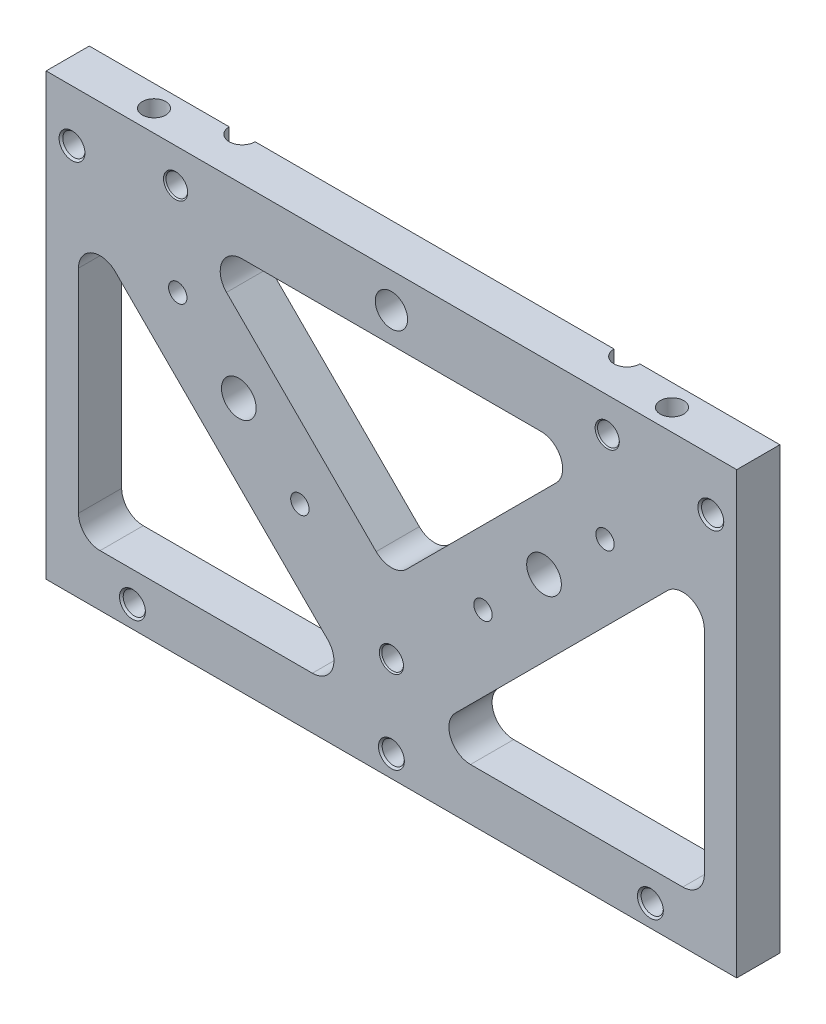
ISO-10303-21;
HEADER;
FILE_DESCRIPTION(('STEP AP214'),'2;1');
FILE_NAME('part.step','',(''),(''),'','','');
FILE_SCHEMA(('AUTOMOTIVE_DESIGN { 1 0 10303 214 1 1 1 1 }'));
ENDSEC;
DATA;
#1=APPLICATION_CONTEXT('core data for automotive mechanical design processes');
#2=APPLICATION_PROTOCOL_DEFINITION('international standard','automotive_design',2000,#1);
#3=PRODUCT_CONTEXT('',#1,'mechanical');
#4=PRODUCT('Part','Part','',(#3));
#5=PRODUCT_RELATED_PRODUCT_CATEGORY('part','',(#4));
#6=PRODUCT_DEFINITION_FORMATION('','',#4);
#7=PRODUCT_DEFINITION_CONTEXT('part definition',#1,'design');
#8=PRODUCT_DEFINITION('design','',#6,#7);
#9=PRODUCT_DEFINITION_SHAPE('','',#8);
#10=(LENGTH_UNIT() NAMED_UNIT(*) SI_UNIT(.MILLI.,.METRE.));
#11=(NAMED_UNIT(*) PLANE_ANGLE_UNIT() SI_UNIT($,.RADIAN.));
#12=(NAMED_UNIT(*) SI_UNIT($,.STERADIAN.) SOLID_ANGLE_UNIT());
#13=UNCERTAINTY_MEASURE_WITH_UNIT(LENGTH_MEASURE(1.E-05),#10,'distance_accuracy_value','');
#14=(GEOMETRIC_REPRESENTATION_CONTEXT(3) GLOBAL_UNCERTAINTY_ASSIGNED_CONTEXT((#13)) GLOBAL_UNIT_ASSIGNED_CONTEXT((#10,
#11,#12)) REPRESENTATION_CONTEXT('',''));
#15=CARTESIAN_POINT('',(0.,0.,0.));
#16=DIRECTION('',(0.,0.,1.));
#17=DIRECTION('',(1.,0.,0.));
#18=AXIS2_PLACEMENT_3D('',#15,#16,#17);
#19=CARTESIAN_POINT('',(50.7999999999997,5.08,8.88178419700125E-13));
#20=DIRECTION('',(0.,0.,-1.));
#21=DIRECTION('',(-1.,0.,0.));
#22=AXIS2_PLACEMENT_3D('',#19,#20,#21);
#23=PLANE('',#22);
#24=DIRECTION('',(0.,1.,0.));
#25=VECTOR('',#24,1.);
#26=CARTESIAN_POINT('',(26.3982199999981,2.5399999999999,8.88178419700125E-13));
#27=LINE('',#26,#25);
#28=CARTESIAN_POINT('',(26.3982199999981,2.5399999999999,8.88178419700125E-13));
#29=VERTEX_POINT('',#28);
#30=CARTESIAN_POINT('',(26.398219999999,5.07999999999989,8.88178419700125E-13));
#31=VERTEX_POINT('',#30);
#32=EDGE_CURVE('E53',#29,#31,#27,.T.);
#33=ORIENTED_EDGE('',*,*,#32,.F.);
#34=DIRECTION('',(-1.,0.,0.));
#35=VECTOR('',#34,1.);
#36=CARTESIAN_POINT('',(26.3982199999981,2.5399999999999,8.88178419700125E-13));
#37=LINE('',#36,#35);
#38=CARTESIAN_POINT('',(30.2082199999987,2.54000000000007,8.88178419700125E-13));
#39=VERTEX_POINT('',#38);
#40=EDGE_CURVE('E218',#39,#29,#37,.T.);
#41=ORIENTED_EDGE('',*,*,#40,.F.);
#42=DIRECTION('',(0.,1.,0.));
#43=VECTOR('',#42,1.);
#44=CARTESIAN_POINT('',(30.2082199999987,2.54000000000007,8.88178419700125E-13));
#45=LINE('',#44,#43);
#46=CARTESIAN_POINT('',(30.2082199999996,5.08000000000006,8.88178419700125E-13));
#47=VERTEX_POINT('',#46);
#48=EDGE_CURVE('E209',#39,#47,#45,.T.);
#49=ORIENTED_EDGE('',*,*,#48,.T.);
#50=DIRECTION('',(-1.,0.,0.));
#51=VECTOR('',#50,1.);
#52=CARTESIAN_POINT('',(-50.8000000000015,5.08,-1.77635683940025E-12));
#53=LINE('',#52,#51);
#54=CARTESIAN_POINT('',(50.7999999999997,5.08,8.88178419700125E-13));
#55=VERTEX_POINT('',#54);
#56=EDGE_CURVE('E455',#55,#47,#53,.T.);
#57=ORIENTED_EDGE('',*,*,#56,.F.);
#58=DIRECTION('',(0.,1.,0.));
#59=VECTOR('',#58,1.);
#60=CARTESIAN_POINT('',(50.799999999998,-59.69,0.));
#61=LINE('',#60,#59);
#62=CARTESIAN_POINT('',(50.799999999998,-59.69,0.));
#63=VERTEX_POINT('',#62);
#64=EDGE_CURVE('E440',#63,#55,#61,.T.);
#65=ORIENTED_EDGE('',*,*,#64,.F.);
#66=DIRECTION('',(1.,0.,0.));
#67=VECTOR('',#66,1.);
#68=CARTESIAN_POINT('',(-50.8000000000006,-59.69,8.88178419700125E-13));
#69=LINE('',#68,#67);
#70=CARTESIAN_POINT('',(-50.8000000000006,-59.69,8.88178419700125E-13));
#71=VERTEX_POINT('',#70);
#72=EDGE_CURVE('E445',#71,#63,#69,.T.);
#73=ORIENTED_EDGE('',*,*,#72,.F.);
#74=DIRECTION('',(0.,-1.,0.));
#75=VECTOR('',#74,1.);
#76=CARTESIAN_POINT('',(-50.8000000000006,-59.69,8.88178419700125E-13));
#77=LINE('',#76,#75);
#78=CARTESIAN_POINT('',(-50.8000000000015,5.08,-1.77635683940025E-12));
#79=VERTEX_POINT('',#78);
#80=EDGE_CURVE('E457',#79,#71,#77,.T.);
#81=ORIENTED_EDGE('',*,*,#80,.F.);
#82=CARTESIAN_POINT('',(-30.2082200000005,5.08000000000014,0.));
#83=VERTEX_POINT('',#82);
#84=EDGE_CURVE('E454',#83,#79,#53,.T.);
#85=ORIENTED_EDGE('',*,*,#84,.F.);
#86=DIRECTION('',(0.,1.,0.));
#87=VECTOR('',#86,1.);
#88=CARTESIAN_POINT('',(-30.2082200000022,2.54000000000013,1.77635683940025E-12));
#89=LINE('',#88,#87);
#90=CARTESIAN_POINT('',(-30.2082200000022,2.54000000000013,1.77635683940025E-12));
#91=VERTEX_POINT('',#90);
#92=EDGE_CURVE('E61',#91,#83,#89,.T.);
#93=ORIENTED_EDGE('',*,*,#92,.F.);
#94=DIRECTION('',(-1.,0.,0.));
#95=VECTOR('',#94,1.);
#96=CARTESIAN_POINT('',(-26.3982200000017,2.54000000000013,8.88178419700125E-13));
#97=LINE('',#96,#95);
#98=CARTESIAN_POINT('',(-26.3982200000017,2.54000000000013,8.88178419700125E-13));
#99=VERTEX_POINT('',#98);
#100=EDGE_CURVE('E233',#99,#91,#97,.T.);
#101=ORIENTED_EDGE('',*,*,#100,.F.);
#102=DIRECTION('',(0.,1.,0.));
#103=VECTOR('',#102,1.);
#104=CARTESIAN_POINT('',(-26.3982200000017,2.54000000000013,8.88178419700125E-13));
#105=LINE('',#104,#103);
#106=CARTESIAN_POINT('',(-26.3982200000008,5.08000000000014,-8.88178419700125E-13));
#107=VERTEX_POINT('',#106);
#108=EDGE_CURVE('E236',#99,#107,#105,.T.);
#109=ORIENTED_EDGE('',*,*,#108,.T.);
#110=EDGE_CURVE('E458',#31,#107,#53,.T.);
#111=ORIENTED_EDGE('',*,*,#110,.F.);
#112=EDGE_LOOP('',(#33,#41,#49,#57,#65,#73,#81,#85,#93,#101,#109,#111));
#113=FACE_BOUND('',#112,.T.);
#114=CARTESIAN_POINT('',(22.4506403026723,-22.4506403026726,1.77635683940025E-12));
#115=DIRECTION('',(0.,0.,-1.));
#116=DIRECTION('',(-1.,0.,0.));
#117=AXIS2_PLACEMENT_3D('',#114,#115,#116);
#118=CIRCLE('',#117,2.55269999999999);
#119=CARTESIAN_POINT('',(19.8979403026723,-22.4506403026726,1.77635683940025E-12));
#120=VERTEX_POINT('',#119);
#121=EDGE_CURVE('E239',#120,#120,#118,.T.);
#122=ORIENTED_EDGE('',*,*,#121,.F.);
#123=EDGE_LOOP('',(#122));
#124=FACE_BOUND('',#123,.T.);
#125=CARTESIAN_POINT('',(-22.450640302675,-22.4506403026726,1.77635683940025E-12));
#126=DIRECTION('',(0.,0.,-1.));
#127=DIRECTION('',(-1.,0.,0.));
#128=AXIS2_PLACEMENT_3D('',#125,#126,#127);
#129=CIRCLE('',#128,2.55269999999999);
#130=CARTESIAN_POINT('',(-25.003340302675,-22.4506403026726,1.77635683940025E-12));
#131=VERTEX_POINT('',#130);
#132=EDGE_CURVE('E247',#131,#131,#129,.T.);
#133=ORIENTED_EDGE('',*,*,#132,.F.);
#134=EDGE_LOOP('',(#133));
#135=FACE_BOUND('',#134,.T.);
#136=CARTESIAN_POINT('',(-31.7499999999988,1.66533453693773E-13,0.));
#137=DIRECTION('',(0.,0.,1.));
#138=DIRECTION('',(1.,0.,0.));
#139=AXIS2_PLACEMENT_3D('',#136,#137,#138);
#140=CIRCLE('',#139,1.778);
#141=CARTESIAN_POINT('',(-29.9719999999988,1.66533453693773E-13,0.));
#142=VERTEX_POINT('',#141);
#143=EDGE_CURVE('E260',#142,#142,#140,.T.);
#144=ORIENTED_EDGE('',*,*,#143,.T.);
#145=EDGE_LOOP('',(#144));
#146=FACE_BOUND('',#145,.T.);
#147=CARTESIAN_POINT('',(31.7499999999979,0.,8.88178419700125E-13));
#148=DIRECTION('',(0.,0.,1.));
#149=DIRECTION('',(1.,0.,0.));
#150=AXIS2_PLACEMENT_3D('',#147,#148,#149);
#151=CIRCLE('',#150,1.778);
#152=CARTESIAN_POINT('',(33.5279999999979,0.,8.88178419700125E-13));
#153=VERTEX_POINT('',#152);
#154=EDGE_CURVE('E272',#153,#153,#151,.T.);
#155=ORIENTED_EDGE('',*,*,#154,.T.);
#156=EDGE_LOOP('',(#155));
#157=FACE_BOUND('',#156,.T.);
#158=CARTESIAN_POINT('',(-8.88178419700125E-13,-44.45,-8.88178419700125E-13));
#159=DIRECTION('',(0.,0.,1.));
#160=DIRECTION('',(1.,0.,0.));
#161=AXIS2_PLACEMENT_3D('',#158,#159,#160);
#162=CIRCLE('',#161,1.778);
#163=CARTESIAN_POINT('',(1.77799999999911,-44.45,-8.88178419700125E-13));
#164=VERTEX_POINT('',#163);
#165=EDGE_CURVE('E284',#164,#164,#162,.T.);
#166=ORIENTED_EDGE('',*,*,#165,.T.);
#167=EDGE_LOOP('',(#166));
#168=FACE_BOUND('',#167,.T.);
#169=CARTESIAN_POINT('',(13.4703841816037,-31.4308964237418,8.88178419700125E-13));
#170=DIRECTION('',(0.,0.,1.));
#171=DIRECTION('',(1.,0.,0.));
#172=AXIS2_PLACEMENT_3D('',#169,#170,#171);
#173=CIRCLE('',#172,1.35255);
#174=CARTESIAN_POINT('',(14.8229341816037,-31.4308964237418,8.88178419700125E-13));
#175=VERTEX_POINT('',#174);
#176=EDGE_CURVE('E305',#175,#175,#173,.T.);
#177=ORIENTED_EDGE('',*,*,#176,.T.);
#178=EDGE_LOOP('',(#177));
#179=FACE_BOUND('',#178,.T.);
#180=DIRECTION('',(1.,0.,0.));
#181=VECTOR('',#180,1.);
#182=CARTESIAN_POINT('',(46.037499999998,-52.07,-1.77635683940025E-12));
#183=LINE('',#182,#181);
#184=CARTESIAN_POINT('',(11.6319262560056,-52.0699999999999,-1.77635683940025E-12));
#185=VERTEX_POINT('',#184);
#186=CARTESIAN_POINT('',(42.8624999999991,-52.07,8.88178419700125E-13));
#187=VERTEX_POINT('',#186);
#188=EDGE_CURVE('E312',#185,#187,#183,.T.);
#189=ORIENTED_EDGE('',*,*,#188,.T.);
#190=CARTESIAN_POINT('',(42.8624999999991,-48.8950000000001,8.88178419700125E-13));
#191=DIRECTION('',(0.,0.,-1.));
#192=DIRECTION('',(-1.,0.,0.));
#193=AXIS2_PLACEMENT_3D('',#190,#191,#192);
#194=CIRCLE('',#193,3.175);
#195=CARTESIAN_POINT('',(46.0374999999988,-48.895,8.88178419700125E-13));
#196=VERTEX_POINT('',#195);
#197=EDGE_CURVE('E517',#187,#196,#194,.F.);
#198=ORIENTED_EDGE('',*,*,#197,.T.);
#199=DIRECTION('',(0.,1.,0.));
#200=VECTOR('',#199,1.);
#201=CARTESIAN_POINT('',(46.037499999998,-9.99929819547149,0.));
#202=LINE('',#201,#200);
#203=CARTESIAN_POINT('',(46.0374999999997,-17.6644262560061,0.));
#204=VERTEX_POINT('',#203);
#205=EDGE_CURVE('E316',#196,#204,#202,.T.);
#206=ORIENTED_EDGE('',*,*,#205,.T.);
#207=CARTESIAN_POINT('',(42.8625,-17.6644262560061,2.66453525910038E-12));
#208=DIRECTION('',(0.,0.,-1.));
#209=DIRECTION('',(-1.,0.,0.));
#210=AXIS2_PLACEMENT_3D('',#207,#208,#209);
#211=CIRCLE('',#210,3.175);
#212=CARTESIAN_POINT('',(40.6174359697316,-15.4193622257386,0.));
#213=VERTEX_POINT('',#212);
#214=EDGE_CURVE('E503',#204,#213,#211,.F.);
#215=ORIENTED_EDGE('',*,*,#214,.T.);
#216=DIRECTION('',(-0.707106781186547,-0.707106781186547,0.));
#217=VECTOR('',#216,1.);
#218=CARTESIAN_POINT('',(3.96679819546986,-52.07,8.88178419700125E-13));
#219=LINE('',#218,#217);
#220=CARTESIAN_POINT('',(9.38686222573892,-46.6499359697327,8.88178419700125E-13));
#221=VERTEX_POINT('',#220);
#222=EDGE_CURVE('E309',#213,#221,#219,.T.);
#223=ORIENTED_EDGE('',*,*,#222,.T.);
#224=CARTESIAN_POINT('',(11.6319262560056,-48.8949999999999,8.88178419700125E-13));
#225=DIRECTION('',(0.,0.,-1.));
#226=DIRECTION('',(-1.,0.,0.));
#227=AXIS2_PLACEMENT_3D('',#224,#225,#226);
#228=CIRCLE('',#227,3.175);
#229=EDGE_CURVE('E521',#221,#185,#228,.F.);
#230=ORIENTED_EDGE('',*,*,#229,.T.);
#231=EDGE_LOOP('',(#189,#198,#206,#215,#223,#230));
#232=FACE_BOUND('',#231,.T.);
#233=DIRECTION('',(0.707106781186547,-0.707106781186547,0.));
#234=VECTOR('',#233,1.);
#235=CARTESIAN_POINT('',(-29.6799732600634,-4.44499999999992,0.));
#236=LINE('',#235,#234);
#237=CARTESIAN_POINT('',(-24.2599092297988,-9.86506403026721,8.88178419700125E-13));
#238=VERTEX_POINT('',#237);
#239=CARTESIAN_POINT('',(-2.24506403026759,-31.8799092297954,-8.88178419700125E-13));
#240=VERTEX_POINT('',#239);
#241=EDGE_CURVE('E328',#238,#240,#236,.T.);
#242=ORIENTED_EDGE('',*,*,#241,.T.);
#243=CARTESIAN_POINT('',(0.,-29.6348451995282,0.));
#244=DIRECTION('',(0.,0.,-1.));
#245=DIRECTION('',(-1.,0.,0.));
#246=AXIS2_PLACEMENT_3D('',#243,#244,#245);
#247=CIRCLE('',#246,3.175);
#248=CARTESIAN_POINT('',(2.24506403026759,-31.8799092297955,0.));
#249=VERTEX_POINT('',#248);
#250=EDGE_CURVE('E530',#240,#249,#247,.F.);
#251=ORIENTED_EDGE('',*,*,#250,.T.);
#252=DIRECTION('',(0.707106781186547,0.707106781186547,0.));
#253=VECTOR('',#252,1.);
#254=CARTESIAN_POINT('',(-8.88178419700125E-13,-34.1249732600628,8.88178419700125E-13));
#255=LINE('',#254,#253);
#256=CARTESIAN_POINT('',(24.2599092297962,-9.86506403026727,1.77635683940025E-12));
#257=VERTEX_POINT('',#256);
#258=EDGE_CURVE('E332',#249,#257,#255,.T.);
#259=ORIENTED_EDGE('',*,*,#258,.T.);
#260=CARTESIAN_POINT('',(22.0148451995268,-7.62000000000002,8.88178419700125E-13));
#261=DIRECTION('',(0.,0.,-1.));
#262=DIRECTION('',(-1.,0.,0.));
#263=AXIS2_PLACEMENT_3D('',#260,#261,#262);
#264=CIRCLE('',#263,3.175);
#265=CARTESIAN_POINT('',(22.0148451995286,-4.44500000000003,8.88178419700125E-13));
#266=VERTEX_POINT('',#265);
#267=EDGE_CURVE('E492',#257,#266,#264,.F.);
#268=ORIENTED_EDGE('',*,*,#267,.T.);
#269=DIRECTION('',(-1.,0.,0.));
#270=VECTOR('',#269,1.);
#271=CARTESIAN_POINT('',(29.6799732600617,-4.445,8.88178419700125E-13));
#272=LINE('',#271,#270);
#273=CARTESIAN_POINT('',(-22.0148451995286,-4.445,-8.88178419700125E-13));
#274=VERTEX_POINT('',#273);
#275=EDGE_CURVE('E325',#266,#274,#272,.T.);
#276=ORIENTED_EDGE('',*,*,#275,.T.);
#277=CARTESIAN_POINT('',(-22.0148451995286,-7.62000000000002,8.88178419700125E-13));
#278=DIRECTION('',(0.,0.,-1.));
#279=DIRECTION('',(-1.,0.,0.));
#280=AXIS2_PLACEMENT_3D('',#277,#278,#279);
#281=CIRCLE('',#280,3.175);
#282=EDGE_CURVE('E487',#274,#238,#281,.F.);
#283=ORIENTED_EDGE('',*,*,#282,.T.);
#284=EDGE_LOOP('',(#242,#251,#259,#268,#276,#283));
#285=FACE_BOUND('',#284,.T.);
#286=DIRECTION('',(-0.707106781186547,0.707106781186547,0.));
#287=VECTOR('',#286,1.);
#288=CARTESIAN_POINT('',(-46.0375000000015,-9.99929819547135,-1.77635683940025E-12));
#289=LINE('',#288,#287);
#290=CARTESIAN_POINT('',(-9.38686222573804,-46.6499359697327,1.77635683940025E-12));
#291=VERTEX_POINT('',#290);
#292=CARTESIAN_POINT('',(-40.6174359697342,-15.4193622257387,8.88178419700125E-13));
#293=VERTEX_POINT('',#292);
#294=EDGE_CURVE('E348',#291,#293,#289,.T.);
#295=ORIENTED_EDGE('',*,*,#294,.T.);
#296=CARTESIAN_POINT('',(-42.8625000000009,-17.6644262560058,8.88178419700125E-13));
#297=DIRECTION('',(0.,0.,-1.));
#298=DIRECTION('',(-1.,0.,0.));
#299=AXIS2_PLACEMENT_3D('',#296,#297,#298);
#300=CIRCLE('',#299,3.175);
#301=CARTESIAN_POINT('',(-46.0375000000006,-17.6644262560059,0.));
#302=VERTEX_POINT('',#301);
#303=EDGE_CURVE('E553',#293,#302,#300,.F.);
#304=ORIENTED_EDGE('',*,*,#303,.T.);
#305=DIRECTION('',(0.,-1.,0.));
#306=VECTOR('',#305,1.);
#307=CARTESIAN_POINT('',(-46.0375000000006,-52.0699999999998,0.));
#308=LINE('',#307,#306);
#309=CARTESIAN_POINT('',(-46.0375000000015,-48.8949999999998,0.));
#310=VERTEX_POINT('',#309);
#311=EDGE_CURVE('E341',#302,#310,#308,.T.);
#312=ORIENTED_EDGE('',*,*,#311,.T.);
#313=CARTESIAN_POINT('',(-42.8625000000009,-48.8949999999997,0.));
#314=DIRECTION('',(0.,0.,-1.));
#315=DIRECTION('',(-1.,0.,0.));
#316=AXIS2_PLACEMENT_3D('',#313,#314,#315);
#317=CIRCLE('',#316,3.175);
#318=CARTESIAN_POINT('',(-42.8625000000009,-52.0699999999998,8.88178419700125E-13));
#319=VERTEX_POINT('',#318);
#320=EDGE_CURVE('E549',#310,#319,#317,.F.);
#321=ORIENTED_EDGE('',*,*,#320,.T.);
#322=DIRECTION('',(1.,0.,0.));
#323=VECTOR('',#322,1.);
#324=CARTESIAN_POINT('',(-3.96679819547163,-52.0699999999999,0.));
#325=LINE('',#324,#323);
#326=CARTESIAN_POINT('',(-11.6319262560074,-52.07,0.));
#327=VERTEX_POINT('',#326);
#328=EDGE_CURVE('E344',#319,#327,#325,.T.);
#329=ORIENTED_EDGE('',*,*,#328,.T.);
#330=CARTESIAN_POINT('',(-11.6319262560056,-48.895,8.88178419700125E-13));
#331=DIRECTION('',(0.,0.,-1.));
#332=DIRECTION('',(-1.,0.,0.));
#333=AXIS2_PLACEMENT_3D('',#330,#331,#332);
#334=CIRCLE('',#333,3.175);
#335=EDGE_CURVE('E11',#327,#291,#334,.F.);
#336=ORIENTED_EDGE('',*,*,#335,.T.);
#337=EDGE_LOOP('',(#295,#304,#312,#321,#329,#336));
#338=FACE_BOUND('',#337,.T.);
#339=CARTESIAN_POINT('',(-46.9900000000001,-2.54000000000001,8.88178419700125E-13));
#340=DIRECTION('',(0.,0.,1.));
#341=DIRECTION('',(1.,0.,0.));
#342=AXIS2_PLACEMENT_3D('',#339,#340,#341);
#343=CIRCLE('',#342,1.905);
#344=CARTESIAN_POINT('',(-45.0850000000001,-2.54000000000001,8.88178419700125E-13));
#345=VERTEX_POINT('',#344);
#346=EDGE_CURVE('E351',#345,#345,#343,.T.);
#347=ORIENTED_EDGE('',*,*,#346,.T.);
#348=EDGE_LOOP('',(#347));
#349=FACE_BOUND('',#348,.T.);
#350=CARTESIAN_POINT('',(46.9900000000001,-2.5399999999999,0.));
#351=DIRECTION('',(0.,0.,1.));
#352=DIRECTION('',(1.,0.,0.));
#353=AXIS2_PLACEMENT_3D('',#350,#351,#352);
#354=CIRCLE('',#353,1.905);
#355=CARTESIAN_POINT('',(48.8950000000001,-2.5399999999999,0.));
#356=VERTEX_POINT('',#355);
#357=EDGE_CURVE('E370',#356,#356,#354,.T.);
#358=ORIENTED_EDGE('',*,*,#357,.T.);
#359=EDGE_LOOP('',(#358));
#360=FACE_BOUND('',#359,.T.);
#361=CARTESIAN_POINT('',(38.0999999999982,-56.515,8.88178419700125E-13));
#362=DIRECTION('',(0.,0.,-1.));
#363=DIRECTION('',(-1.,0.,0.));
#364=AXIS2_PLACEMENT_3D('',#361,#362,#363);
#365=CIRCLE('',#364,1.905);
#366=CARTESIAN_POINT('',(36.1949999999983,-56.515,8.88178419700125E-13));
#367=VERTEX_POINT('',#366);
#368=EDGE_CURVE('E385',#367,#367,#365,.T.);
#369=ORIENTED_EDGE('',*,*,#368,.F.);
#370=EDGE_LOOP('',(#369));
#371=FACE_BOUND('',#370,.T.);
#372=CARTESIAN_POINT('',(0.,-56.515,0.));
#373=DIRECTION('',(0.,0.,-1.));
#374=DIRECTION('',(-1.,0.,0.));
#375=AXIS2_PLACEMENT_3D('',#372,#373,#374);
#376=CIRCLE('',#375,1.905);
#377=CARTESIAN_POINT('',(-1.905,-56.515,0.));
#378=VERTEX_POINT('',#377);
#379=EDGE_CURVE('E397',#378,#378,#376,.T.);
#380=ORIENTED_EDGE('',*,*,#379,.F.);
#381=EDGE_LOOP('',(#380));
#382=FACE_BOUND('',#381,.T.);
#383=CARTESIAN_POINT('',(-38.1000000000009,-56.5149999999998,0.));
#384=DIRECTION('',(0.,0.,-1.));
#385=DIRECTION('',(-1.,0.,0.));
#386=AXIS2_PLACEMENT_3D('',#383,#384,#385);
#387=CIRCLE('',#386,1.905);
#388=CARTESIAN_POINT('',(-40.0050000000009,-56.5149999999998,0.));
#389=VERTEX_POINT('',#388);
#390=EDGE_CURVE('E409',#389,#389,#387,.T.);
#391=ORIENTED_EDGE('',*,*,#390,.F.);
#392=EDGE_LOOP('',(#391));
#393=FACE_BOUND('',#392,.T.);
#394=CARTESIAN_POINT('',(0.,0.,0.));
#395=DIRECTION('',(0.,0.,-1.));
#396=DIRECTION('',(-1.,0.,0.));
#397=AXIS2_PLACEMENT_3D('',#394,#395,#396);
#398=CIRCLE('',#397,3.1877);
#399=CARTESIAN_POINT('',(-3.1877,0.,0.));
#400=VERTEX_POINT('',#399);
#401=EDGE_CURVE('E418',#400,#400,#398,.T.);
#402=ORIENTED_EDGE('',*,*,#401,.F.);
#403=EDGE_LOOP('',(#402));
#404=FACE_BOUND('',#403,.T.);
#405=CARTESIAN_POINT('',(-31.4308964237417,-13.4703841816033,-8.88178419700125E-13));
#406=DIRECTION('',(0.,0.,1.));
#407=DIRECTION('',(1.,0.,0.));
#408=AXIS2_PLACEMENT_3D('',#405,#406,#407);
#409=CIRCLE('',#408,1.35255);
#410=CARTESIAN_POINT('',(-30.0783464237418,-13.4703841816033,-8.88178419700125E-13));
#411=VERTEX_POINT('',#410);
#412=EDGE_CURVE('E428',#411,#411,#409,.T.);
#413=ORIENTED_EDGE('',*,*,#412,.T.);
#414=EDGE_LOOP('',(#413));
#415=FACE_BOUND('',#414,.T.);
#416=CARTESIAN_POINT('',(-13.4703841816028,-31.4308964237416,8.88178419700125E-13));
#417=DIRECTION('',(0.,0.,1.));
#418=DIRECTION('',(1.,0.,0.));
#419=AXIS2_PLACEMENT_3D('',#416,#417,#418);
#420=CIRCLE('',#419,1.35255);
#421=CARTESIAN_POINT('',(-12.1178341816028,-31.4308964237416,8.88178419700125E-13));
#422=VERTEX_POINT('',#421);
#423=EDGE_CURVE('E434',#422,#422,#420,.T.);
#424=ORIENTED_EDGE('',*,*,#423,.T.);
#425=EDGE_LOOP('',(#424));
#426=FACE_BOUND('',#425,.T.);
#427=CARTESIAN_POINT('',(31.4308964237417,-13.4703841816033,1.77635683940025E-12));
#428=DIRECTION('',(0.,0.,1.));
#429=DIRECTION('',(1.,0.,0.));
#430=AXIS2_PLACEMENT_3D('',#427,#428,#429);
#431=CIRCLE('',#430,1.35255);
#432=CARTESIAN_POINT('',(32.7834464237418,-13.4703841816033,1.77635683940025E-12));
#433=VERTEX_POINT('',#432);
#434=EDGE_CURVE('E299',#433,#433,#431,.T.);
#435=ORIENTED_EDGE('',*,*,#434,.T.);
#436=EDGE_LOOP('',(#435));
#437=FACE_BOUND('',#436,.T.);
#438=ADVANCED_FACE('F36',(#113,#124,#135,#146,#157,#168,#179,#232,#285,#338,#349,#360,#371,#382,
#393,#404,#415,#426,#437),#23,.T.);
#439=CARTESIAN_POINT('',(50.7999999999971,5.08000000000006,6.34999999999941));
#440=DIRECTION('',(0.,0.,-1.));
#441=DIRECTION('',(-1.,0.,0.));
#442=AXIS2_PLACEMENT_3D('',#439,#440,#441);
#443=PLANE('',#442);
#444=CARTESIAN_POINT('',(22.4506403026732,-22.4506403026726,6.35000000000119));
#445=DIRECTION('',(0.,0.,-1.));
#446=DIRECTION('',(-1.,0.,0.));
#447=AXIS2_PLACEMENT_3D('',#444,#445,#446);
#448=CIRCLE('',#447,2.5527);
#449=CARTESIAN_POINT('',(19.8979403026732,-22.4506403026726,6.35000000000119));
#450=VERTEX_POINT('',#449);
#451=EDGE_CURVE('E244',#450,#450,#448,.T.);
#452=ORIENTED_EDGE('',*,*,#451,.T.);
#453=EDGE_LOOP('',(#452));
#454=FACE_BOUND('',#453,.T.);
#455=CARTESIAN_POINT('',(-22.4506403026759,-22.4506403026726,6.3500000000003));
#456=DIRECTION('',(0.,0.,-1.));
#457=DIRECTION('',(-1.,0.,0.));
#458=AXIS2_PLACEMENT_3D('',#455,#456,#457);
#459=CIRCLE('',#458,2.5527);
#460=CARTESIAN_POINT('',(-25.0033403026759,-22.4506403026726,6.3500000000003));
#461=VERTEX_POINT('',#460);
#462=EDGE_CURVE('E250',#461,#461,#459,.T.);
#463=ORIENTED_EDGE('',*,*,#462,.T.);
#464=EDGE_LOOP('',(#463));
#465=FACE_BOUND('',#464,.T.);
#466=CARTESIAN_POINT('',(-31.7499999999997,0.,6.35000000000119));
#467=DIRECTION('',(0.,0.,1.));
#468=DIRECTION('',(1.,0.,0.));
#469=AXIS2_PLACEMENT_3D('',#466,#467,#468);
#470=CIRCLE('',#469,1.778);
#471=CARTESIAN_POINT('',(-29.9719999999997,0.,6.35000000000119));
#472=VERTEX_POINT('',#471);
#473=EDGE_CURVE('E263',#472,#472,#470,.T.);
#474=ORIENTED_EDGE('',*,*,#473,.F.);
#475=EDGE_LOOP('',(#474));
#476=FACE_BOUND('',#475,.T.);
#477=CARTESIAN_POINT('',(31.7499999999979,0.,6.35000000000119));
#478=DIRECTION('',(0.,0.,1.));
#479=DIRECTION('',(1.,0.,0.));
#480=AXIS2_PLACEMENT_3D('',#477,#478,#479);
#481=CIRCLE('',#480,1.778);
#482=CARTESIAN_POINT('',(33.5279999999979,0.,6.35000000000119));
#483=VERTEX_POINT('',#482);
#484=EDGE_CURVE('E275',#483,#483,#481,.T.);
#485=ORIENTED_EDGE('',*,*,#484,.F.);
#486=EDGE_LOOP('',(#485));
#487=FACE_BOUND('',#486,.T.);
#488=CARTESIAN_POINT('',(-1.77635683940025E-12,-44.4499999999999,6.35000000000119));
#489=DIRECTION('',(0.,0.,1.));
#490=DIRECTION('',(1.,0.,0.));
#491=AXIS2_PLACEMENT_3D('',#488,#489,#490);
#492=CIRCLE('',#491,1.778);
#493=CARTESIAN_POINT('',(1.77799999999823,-44.4499999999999,6.35000000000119));
#494=VERTEX_POINT('',#493);
#495=EDGE_CURVE('E287',#494,#494,#492,.T.);
#496=ORIENTED_EDGE('',*,*,#495,.F.);
#497=EDGE_LOOP('',(#496));
#498=FACE_BOUND('',#497,.T.);
#499=CARTESIAN_POINT('',(13.4703841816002,-31.4308964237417,6.35000000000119));
#500=DIRECTION('',(0.,0.,1.));
#501=DIRECTION('',(1.,0.,0.));
#502=AXIS2_PLACEMENT_3D('',#499,#500,#501);
#503=CIRCLE('',#502,1.35254999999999);
#504=CARTESIAN_POINT('',(14.8229341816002,-31.4308964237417,6.35000000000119));
#505=VERTEX_POINT('',#504);
#506=EDGE_CURVE('E302',#505,#505,#503,.T.);
#507=ORIENTED_EDGE('',*,*,#506,.F.);
#508=EDGE_LOOP('',(#507));
#509=FACE_BOUND('',#508,.T.);
#510=DIRECTION('',(1.,0.,0.));
#511=VECTOR('',#510,1.);
#512=CARTESIAN_POINT('',(46.0374999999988,-52.07,6.34999999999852));
#513=LINE('',#512,#511);
#514=CARTESIAN_POINT('',(11.631926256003,-52.07,6.3500000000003));
#515=VERTEX_POINT('',#514);
#516=CARTESIAN_POINT('',(42.8625,-52.07,6.3500000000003));
#517=VERTEX_POINT('',#516);
#518=EDGE_CURVE('E321',#515,#517,#513,.T.);
#519=ORIENTED_EDGE('',*,*,#518,.F.);
#520=CARTESIAN_POINT('',(11.6319262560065,-48.8949999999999,6.3500000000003));
#521=DIRECTION('',(0.,0.,-1.));
#522=DIRECTION('',(-1.,0.,0.));
#523=AXIS2_PLACEMENT_3D('',#520,#521,#522);
#524=CIRCLE('',#523,3.175);
#525=CARTESIAN_POINT('',(9.38686222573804,-46.6499359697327,6.35000000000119));
#526=VERTEX_POINT('',#525);
#527=EDGE_CURVE('E519',#515,#526,#524,.T.);
#528=ORIENTED_EDGE('',*,*,#527,.T.);
#529=DIRECTION('',(-0.707106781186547,-0.707106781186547,0.));
#530=VECTOR('',#529,1.);
#531=CARTESIAN_POINT('',(3.96679819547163,-52.0699999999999,6.3500000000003));
#532=LINE('',#531,#530);
#533=CARTESIAN_POINT('',(40.6174359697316,-15.4193622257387,6.35000000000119));
#534=VERTEX_POINT('',#533);
#535=EDGE_CURVE('E308',#534,#526,#532,.T.);
#536=ORIENTED_EDGE('',*,*,#535,.F.);
#537=CARTESIAN_POINT('',(42.8625,-17.6644262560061,6.34999999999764));
#538=DIRECTION('',(0.,0.,-1.));
#539=DIRECTION('',(-1.,0.,0.));
#540=AXIS2_PLACEMENT_3D('',#537,#538,#539);
#541=CIRCLE('',#540,3.175);
#542=CARTESIAN_POINT('',(46.0375000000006,-17.6644262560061,6.35000000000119));
#543=VERTEX_POINT('',#542);
#544=EDGE_CURVE('E500',#534,#543,#541,.T.);
#545=ORIENTED_EDGE('',*,*,#544,.T.);
#546=DIRECTION('',(0.,1.,0.));
#547=VECTOR('',#546,1.);
#548=CARTESIAN_POINT('',(46.0374999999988,-9.99929819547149,6.34999999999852));
#549=LINE('',#548,#547);
#550=CARTESIAN_POINT('',(46.0374999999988,-48.895,6.34999999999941));
#551=VERTEX_POINT('',#550);
#552=EDGE_CURVE('E313',#551,#543,#549,.T.);
#553=ORIENTED_EDGE('',*,*,#552,.F.);
#554=CARTESIAN_POINT('',(42.8624999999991,-48.895,6.3500000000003));
#555=DIRECTION('',(0.,0.,-1.));
#556=DIRECTION('',(-1.,0.,0.));
#557=AXIS2_PLACEMENT_3D('',#554,#555,#556);
#558=CIRCLE('',#557,3.175);
#559=EDGE_CURVE('E515',#551,#517,#558,.T.);
#560=ORIENTED_EDGE('',*,*,#559,.T.);
#561=EDGE_LOOP('',(#519,#528,#536,#545,#553,#560));
#562=FACE_BOUND('',#561,.T.);
#563=DIRECTION('',(0.707106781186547,-0.707106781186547,0.));
#564=VECTOR('',#563,1.);
#565=CARTESIAN_POINT('',(-29.6799732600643,-4.445,6.3500000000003));
#566=LINE('',#565,#564);
#567=CARTESIAN_POINT('',(-24.2599092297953,-9.86506403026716,6.3500000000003));
#568=VERTEX_POINT('',#567);
#569=CARTESIAN_POINT('',(-2.24506403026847,-31.8799092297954,6.3500000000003));
#570=VERTEX_POINT('',#569);
#571=EDGE_CURVE('E337',#568,#570,#566,.T.);
#572=ORIENTED_EDGE('',*,*,#571,.F.);
#573=CARTESIAN_POINT('',(-22.0148451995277,-7.62000000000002,6.34999999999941));
#574=DIRECTION('',(0.,0.,-1.));
#575=DIRECTION('',(-1.,0.,0.));
#576=AXIS2_PLACEMENT_3D('',#573,#574,#575);
#577=CIRCLE('',#576,3.175);
#578=CARTESIAN_POINT('',(-22.0148451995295,-4.445,6.3500000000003));
#579=VERTEX_POINT('',#578);
#580=EDGE_CURVE('E485',#568,#579,#577,.T.);
#581=ORIENTED_EDGE('',*,*,#580,.T.);
#582=DIRECTION('',(-1.,0.,0.));
#583=VECTOR('',#582,1.);
#584=CARTESIAN_POINT('',(29.6799732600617,-4.44500000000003,6.3500000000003));
#585=LINE('',#584,#583);
#586=CARTESIAN_POINT('',(22.0148451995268,-4.445,6.35000000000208));
#587=VERTEX_POINT('',#586);
#588=EDGE_CURVE('E318',#587,#579,#585,.T.);
#589=ORIENTED_EDGE('',*,*,#588,.F.);
#590=CARTESIAN_POINT('',(22.0148451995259,-7.61999999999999,6.35000000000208));
#591=DIRECTION('',(0.,0.,-1.));
#592=DIRECTION('',(-1.,0.,0.));
#593=AXIS2_PLACEMENT_3D('',#590,#591,#592);
#594=CIRCLE('',#593,3.175);
#595=CARTESIAN_POINT('',(24.2599092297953,-9.86506403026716,6.34999999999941));
#596=VERTEX_POINT('',#595);
#597=EDGE_CURVE('E489',#587,#596,#594,.T.);
#598=ORIENTED_EDGE('',*,*,#597,.T.);
#599=DIRECTION('',(0.707106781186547,0.707106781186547,0.));
#600=VECTOR('',#599,1.);
#601=CARTESIAN_POINT('',(-1.77635683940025E-12,-34.1249732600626,6.34999999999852));
#602=LINE('',#601,#600);
#603=CARTESIAN_POINT('',(2.2450640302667,-31.8799092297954,6.3500000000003));
#604=VERTEX_POINT('',#603);
#605=EDGE_CURVE('E329',#604,#596,#602,.T.);
#606=ORIENTED_EDGE('',*,*,#605,.F.);
#607=CARTESIAN_POINT('',(-1.77635683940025E-12,-29.6348451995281,6.3500000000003));
#608=DIRECTION('',(0.,0.,-1.));
#609=DIRECTION('',(-1.,0.,0.));
#610=AXIS2_PLACEMENT_3D('',#607,#608,#609);
#611=CIRCLE('',#610,3.175);
#612=EDGE_CURVE('E528',#604,#570,#611,.T.);
#613=ORIENTED_EDGE('',*,*,#612,.T.);
#614=EDGE_LOOP('',(#572,#581,#589,#598,#606,#613));
#615=FACE_BOUND('',#614,.T.);
#616=DIRECTION('',(1.,0.,0.));
#617=VECTOR('',#616,1.);
#618=CARTESIAN_POINT('',(-3.96679819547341,-52.0699999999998,6.35000000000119));
#619=LINE('',#618,#617);
#620=CARTESIAN_POINT('',(-42.8625000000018,-52.0699999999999,6.35000000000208));
#621=VERTEX_POINT('',#620);
#622=CARTESIAN_POINT('',(-11.6319262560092,-52.07,6.35000000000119));
#623=VERTEX_POINT('',#622);
#624=EDGE_CURVE('E354',#621,#623,#619,.T.);
#625=ORIENTED_EDGE('',*,*,#624,.F.);
#626=CARTESIAN_POINT('',(-42.8625,-48.8949999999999,6.34999999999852));
#627=DIRECTION('',(0.,0.,-1.));
#628=DIRECTION('',(-1.,0.,0.));
#629=AXIS2_PLACEMENT_3D('',#626,#627,#628);
#630=CIRCLE('',#629,3.175);
#631=CARTESIAN_POINT('',(-46.0375000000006,-48.895,6.3500000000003));
#632=VERTEX_POINT('',#631);
#633=EDGE_CURVE('E547',#621,#632,#630,.T.);
#634=ORIENTED_EDGE('',*,*,#633,.T.);
#635=DIRECTION('',(0.,-1.,0.));
#636=VECTOR('',#635,1.);
#637=CARTESIAN_POINT('',(-46.0375000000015,-52.07,6.35000000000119));
#638=LINE('',#637,#636);
#639=CARTESIAN_POINT('',(-46.0375000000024,-17.664426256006,6.34999999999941));
#640=VERTEX_POINT('',#639);
#641=EDGE_CURVE('E334',#640,#632,#638,.T.);
#642=ORIENTED_EDGE('',*,*,#641,.F.);
#643=CARTESIAN_POINT('',(-42.8625,-17.664426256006,6.35000000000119));
#644=DIRECTION('',(0.,0.,-1.));
#645=DIRECTION('',(-1.,0.,0.));
#646=AXIS2_PLACEMENT_3D('',#643,#644,#645);
#647=CIRCLE('',#646,3.175);
#648=CARTESIAN_POINT('',(-40.6174359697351,-15.4193622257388,6.34999999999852));
#649=VERTEX_POINT('',#648);
#650=EDGE_CURVE('E551',#640,#649,#647,.T.);
#651=ORIENTED_EDGE('',*,*,#650,.T.);
#652=DIRECTION('',(-0.707106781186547,0.707106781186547,0.));
#653=VECTOR('',#652,1.);
#654=CARTESIAN_POINT('',(-46.0375000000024,-9.99929819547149,6.34999999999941));
#655=LINE('',#654,#653);
#656=CARTESIAN_POINT('',(-9.38686222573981,-46.6499359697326,6.35000000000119));
#657=VERTEX_POINT('',#656);
#658=EDGE_CURVE('E345',#657,#649,#655,.T.);
#659=ORIENTED_EDGE('',*,*,#658,.F.);
#660=CARTESIAN_POINT('',(-11.6319262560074,-48.895,6.3500000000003));
#661=DIRECTION('',(0.,0.,-1.));
#662=DIRECTION('',(-1.,0.,0.));
#663=AXIS2_PLACEMENT_3D('',#660,#661,#662);
#664=CIRCLE('',#663,3.175);
#665=EDGE_CURVE('E45',#657,#623,#664,.T.);
#666=ORIENTED_EDGE('',*,*,#665,.T.);
#667=EDGE_LOOP('',(#625,#634,#642,#651,#659,#666));
#668=FACE_BOUND('',#667,.T.);
#669=CARTESIAN_POINT('',(46.9899999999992,-2.5399999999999,6.3500000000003));
#670=DIRECTION('',(0.,0.,1.));
#671=DIRECTION('',(1.,0.,0.));
#672=AXIS2_PLACEMENT_3D('',#669,#670,#671);
#673=CIRCLE('',#672,1.905);
#674=CARTESIAN_POINT('',(48.8949999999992,-2.5399999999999,6.3500000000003));
#675=VERTEX_POINT('',#674);
#676=EDGE_CURVE('E373',#675,#675,#673,.T.);
#677=ORIENTED_EDGE('',*,*,#676,.F.);
#678=EDGE_LOOP('',(#677));
#679=FACE_BOUND('',#678,.T.);
#680=CARTESIAN_POINT('',(38.0999999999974,-56.5150000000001,6.3500000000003));
#681=DIRECTION('',(0.,0.,-1.));
#682=DIRECTION('',(-1.,0.,0.));
#683=AXIS2_PLACEMENT_3D('',#680,#681,#682);
#684=CIRCLE('',#683,1.905);
#685=CARTESIAN_POINT('',(36.1949999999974,-56.5150000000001,6.3500000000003));
#686=VERTEX_POINT('',#685);
#687=EDGE_CURVE('E382',#686,#686,#684,.T.);
#688=ORIENTED_EDGE('',*,*,#687,.T.);
#689=EDGE_LOOP('',(#688));
#690=FACE_BOUND('',#689,.T.);
#691=CARTESIAN_POINT('',(-8.88178419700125E-13,-56.5149999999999,6.3500000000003));
#692=DIRECTION('',(0.,0.,-1.));
#693=DIRECTION('',(-1.,0.,0.));
#694=AXIS2_PLACEMENT_3D('',#691,#692,#693);
#695=CIRCLE('',#694,1.905);
#696=CARTESIAN_POINT('',(-1.90500000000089,-56.5149999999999,6.3500000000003));
#697=VERTEX_POINT('',#696);
#698=EDGE_CURVE('E394',#697,#697,#695,.T.);
#699=ORIENTED_EDGE('',*,*,#698,.T.);
#700=EDGE_LOOP('',(#699));
#701=FACE_BOUND('',#700,.T.);
#702=CARTESIAN_POINT('',(-38.1000000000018,-56.5149999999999,6.34999999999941));
#703=DIRECTION('',(0.,0.,-1.));
#704=DIRECTION('',(-1.,0.,0.));
#705=AXIS2_PLACEMENT_3D('',#702,#703,#704);
#706=CIRCLE('',#705,1.905);
#707=CARTESIAN_POINT('',(-40.0050000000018,-56.5149999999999,6.34999999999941));
#708=VERTEX_POINT('',#707);
#709=EDGE_CURVE('E406',#708,#708,#706,.T.);
#710=ORIENTED_EDGE('',*,*,#709,.T.);
#711=EDGE_LOOP('',(#710));
#712=FACE_BOUND('',#711,.T.);
#713=CARTESIAN_POINT('',(-31.4308964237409,-13.4703841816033,6.3500000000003));
#714=DIRECTION('',(0.,0.,1.));
#715=DIRECTION('',(1.,0.,0.));
#716=AXIS2_PLACEMENT_3D('',#713,#714,#715);
#717=CIRCLE('',#716,1.35254999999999);
#718=CARTESIAN_POINT('',(-30.0783464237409,-13.4703841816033,6.3500000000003));
#719=VERTEX_POINT('',#718);
#720=EDGE_CURVE('E425',#719,#719,#717,.T.);
#721=ORIENTED_EDGE('',*,*,#720,.F.);
#722=EDGE_LOOP('',(#721));
#723=FACE_BOUND('',#722,.T.);
#724=CARTESIAN_POINT('',(-13.4703841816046,-31.4308964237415,6.3500000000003));
#725=DIRECTION('',(0.,0.,1.));
#726=DIRECTION('',(1.,0.,0.));
#727=AXIS2_PLACEMENT_3D('',#724,#725,#726);
#728=CIRCLE('',#727,1.35254999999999);
#729=CARTESIAN_POINT('',(-12.1178341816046,-31.4308964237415,6.3500000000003));
#730=VERTEX_POINT('',#729);
#731=EDGE_CURVE('E431',#730,#730,#728,.T.);
#732=ORIENTED_EDGE('',*,*,#731,.F.);
#733=EDGE_LOOP('',(#732));
#734=FACE_BOUND('',#733,.T.);
#735=CARTESIAN_POINT('',(0.,1.38777878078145E-13,6.3500000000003));
#736=DIRECTION('',(0.,0.,1.));
#737=DIRECTION('',(1.,0.,0.));
#738=AXIS2_PLACEMENT_3D('',#735,#736,#737);
#739=CIRCLE('',#738,2.38125);
#740=CARTESIAN_POINT('',(2.38125,1.38777878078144E-13,6.3500000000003));
#741=VERTEX_POINT('',#740);
#742=EDGE_CURVE('E437',#741,#741,#739,.T.);
#743=ORIENTED_EDGE('',*,*,#742,.F.);
#744=EDGE_LOOP('',(#743));
#745=FACE_BOUND('',#744,.T.);
#746=DIRECTION('',(0.,1.,0.));
#747=VECTOR('',#746,1.);
#748=CARTESIAN_POINT('',(50.7999999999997,-59.6899999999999,6.35000000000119));
#749=LINE('',#748,#747);
#750=CARTESIAN_POINT('',(50.7999999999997,-59.6899999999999,6.35000000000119));
#751=VERTEX_POINT('',#750);
#752=CARTESIAN_POINT('',(50.7999999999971,5.08000000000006,6.34999999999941));
#753=VERTEX_POINT('',#752);
#754=EDGE_CURVE('E441',#751,#753,#749,.T.);
#755=ORIENTED_EDGE('',*,*,#754,.T.);
#756=DIRECTION('',(-1.,0.,0.));
#757=VECTOR('',#756,1.);
#758=CARTESIAN_POINT('',(-50.8000000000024,5.08000000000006,6.3500000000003));
#759=LINE('',#758,#757);
#760=CARTESIAN_POINT('',(-50.8000000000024,5.08000000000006,6.3500000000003));
#761=VERTEX_POINT('',#760);
#762=EDGE_CURVE('E444',#753,#761,#759,.T.);
#763=ORIENTED_EDGE('',*,*,#762,.T.);
#764=DIRECTION('',(0.,-1.,0.));
#765=VECTOR('',#764,1.);
#766=CARTESIAN_POINT('',(-50.8000000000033,-59.69,6.34999999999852));
#767=LINE('',#766,#765);
#768=CARTESIAN_POINT('',(-50.8000000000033,-59.69,6.34999999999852));
#769=VERTEX_POINT('',#768);
#770=EDGE_CURVE('E447',#761,#769,#767,.T.);
#771=ORIENTED_EDGE('',*,*,#770,.T.);
#772=DIRECTION('',(1.,0.,0.));
#773=VECTOR('',#772,1.);
#774=CARTESIAN_POINT('',(-50.8000000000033,-59.69,6.34999999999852));
#775=LINE('',#774,#773);
#776=EDGE_CURVE('E449',#769,#751,#775,.T.);
#777=ORIENTED_EDGE('',*,*,#776,.T.);
#778=EDGE_LOOP('',(#755,#763,#771,#777));
#779=FACE_BOUND('',#778,.T.);
#780=CARTESIAN_POINT('',(-46.9900000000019,-2.54000000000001,6.3500000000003));
#781=DIRECTION('',(0.,0.,1.));
#782=DIRECTION('',(1.,0.,0.));
#783=AXIS2_PLACEMENT_3D('',#780,#781,#782);
#784=CIRCLE('',#783,1.905);
#785=CARTESIAN_POINT('',(-45.0850000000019,-2.54000000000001,6.3500000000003));
#786=VERTEX_POINT('',#785);
#787=EDGE_CURVE('E361',#786,#786,#784,.T.);
#788=ORIENTED_EDGE('',*,*,#787,.F.);
#789=EDGE_LOOP('',(#788));
#790=FACE_BOUND('',#789,.T.);
#791=CARTESIAN_POINT('',(31.43089642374,-13.4703841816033,6.34999999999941));
#792=DIRECTION('',(0.,0.,1.));
#793=DIRECTION('',(1.,0.,0.));
#794=AXIS2_PLACEMENT_3D('',#791,#792,#793);
#795=CIRCLE('',#794,1.35254999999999);
#796=CARTESIAN_POINT('',(32.78344642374,-13.4703841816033,6.34999999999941));
#797=VERTEX_POINT('',#796);
#798=EDGE_CURVE('E296',#797,#797,#795,.T.);
#799=ORIENTED_EDGE('',*,*,#798,.F.);
#800=EDGE_LOOP('',(#799));
#801=FACE_BOUND('',#800,.T.);
#802=ADVANCED_FACE('F578',(#454,#465,#476,#487,#498,#509,#562,#615,#668,#679,#690,#701,#712,
#723,#734,#745,#779,#790,#801),#443,.F.);
#803=CARTESIAN_POINT('',(0.,1.38777878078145E-13,6.3500000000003));
#804=DIRECTION('',(0.,0.,1.));
#805=DIRECTION('',(1.,0.,0.));
#806=AXIS2_PLACEMENT_3D('',#803,#804,#805);
#807=CYLINDRICAL_SURFACE('',#806,2.38125);
#808=ORIENTED_EDGE('',*,*,#742,.T.);
#809=EDGE_LOOP('',(#808));
#810=FACE_BOUND('',#809,.T.);
#811=CARTESIAN_POINT('',(0.,0.,0.761999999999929));
#812=DIRECTION('',(0.,0.,-1.));
#813=DIRECTION('',(-1.,0.,0.));
#814=AXIS2_PLACEMENT_3D('',#811,#812,#813);
#815=CIRCLE('',#814,2.38125);
#816=CARTESIAN_POINT('',(-2.38125,0.,0.761999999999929));
#817=VERTEX_POINT('',#816);
#818=EDGE_CURVE('E422',#817,#817,#815,.F.);
#819=ORIENTED_EDGE('',*,*,#818,.F.);
#820=EDGE_LOOP('',(#819));
#821=FACE_BOUND('',#820,.T.);
#822=ADVANCED_FACE('F583',(#810,#821),#807,.F.);
#823=CARTESIAN_POINT('',(50.7999999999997,-59.6899999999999,6.35000000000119));
#824=DIRECTION('',(-1.,0.,0.));
#825=DIRECTION('',(0.,0.,1.));
#826=AXIS2_PLACEMENT_3D('',#823,#824,#825);
#827=PLANE('',#826);
#828=ORIENTED_EDGE('',*,*,#64,.T.);
#829=DIRECTION('',(0.,0.,-1.));
#830=VECTOR('',#829,1.);
#831=CARTESIAN_POINT('',(50.7999999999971,5.08000000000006,6.34999999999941));
#832=LINE('',#831,#830);
#833=EDGE_CURVE('E469',#753,#55,#832,.T.);
#834=ORIENTED_EDGE('',*,*,#833,.F.);
#835=ORIENTED_EDGE('',*,*,#754,.F.);
#836=DIRECTION('',(0.,0.,-1.));
#837=VECTOR('',#836,1.);
#838=CARTESIAN_POINT('',(50.7999999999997,-59.6899999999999,6.35000000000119));
#839=LINE('',#838,#837);
#840=EDGE_CURVE('E451',#751,#63,#839,.T.);
#841=ORIENTED_EDGE('',*,*,#840,.T.);
#842=EDGE_LOOP('',(#828,#834,#835,#841));
#843=FACE_BOUND('',#842,.T.);
#844=ADVANCED_FACE('F600',(#843),#827,.F.);
#845=CARTESIAN_POINT('',(-50.8000000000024,5.08000000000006,6.3500000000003));
#846=DIRECTION('',(0.,-1.,0.));
#847=DIRECTION('',(0.,0.,-1.));
#848=AXIS2_PLACEMENT_3D('',#845,#846,#847);
#849=PLANE('',#848);
#850=CARTESIAN_POINT('',(38.0999999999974,5.07999999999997,3.17500000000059));
#851=DIRECTION('',(0.,1.,0.));
#852=DIRECTION('',(0.,0.,1.));
#853=AXIS2_PLACEMENT_3D('',#850,#851,#852);
#854=CIRCLE('',#853,1.7272);
#855=CARTESIAN_POINT('',(38.0999999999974,5.07999999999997,4.90220000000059));
#856=VERTEX_POINT('',#855);
#857=EDGE_CURVE('E253',#856,#856,#854,.T.);
#858=ORIENTED_EDGE('',*,*,#857,.F.);
#859=EDGE_LOOP('',(#858));
#860=FACE_BOUND('',#859,.T.);
#861=CARTESIAN_POINT('',(-38.1000000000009,5.08000000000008,3.17500000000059));
#862=DIRECTION('',(0.,1.,0.));
#863=DIRECTION('',(0.,0.,1.));
#864=AXIS2_PLACEMENT_3D('',#861,#862,#863);
#865=CIRCLE('',#864,1.7272);
#866=CARTESIAN_POINT('',(-38.1000000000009,5.08000000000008,4.90220000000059));
#867=VERTEX_POINT('',#866);
#868=EDGE_CURVE('E256',#867,#867,#865,.T.);
#869=ORIENTED_EDGE('',*,*,#868,.F.);
#870=EDGE_LOOP('',(#869));
#871=FACE_BOUND('',#870,.T.);
#872=ORIENTED_EDGE('',*,*,#56,.T.);
#873=CARTESIAN_POINT('',(28.3032199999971,5.08000000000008,0.));
#874=DIRECTION('',(0.,1.,0.));
#875=DIRECTION('',(0.,0.,1.));
#876=AXIS2_PLACEMENT_3D('',#873,#874,#875);
#877=CIRCLE('',#876,1.905);
#878=EDGE_CURVE('E214',#31,#47,#877,.T.);
#879=ORIENTED_EDGE('',*,*,#878,.F.);
#880=ORIENTED_EDGE('',*,*,#110,.T.);
#881=CARTESIAN_POINT('',(-28.3032200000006,5.08000000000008,-8.88178419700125E-13));
#882=DIRECTION('',(0.,1.,0.));
#883=DIRECTION('',(0.,0.,-1.));
#884=AXIS2_PLACEMENT_3D('',#881,#882,#883);
#885=CIRCLE('',#884,1.905);
#886=EDGE_CURVE('E228',#83,#107,#885,.T.);
#887=ORIENTED_EDGE('',*,*,#886,.F.);
#888=ORIENTED_EDGE('',*,*,#84,.T.);
#889=DIRECTION('',(0.,0.,-1.));
#890=VECTOR('',#889,1.);
#891=CARTESIAN_POINT('',(-50.8000000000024,5.08000000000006,6.3500000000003));
#892=LINE('',#891,#890);
#893=EDGE_CURVE('E466',#761,#79,#892,.T.);
#894=ORIENTED_EDGE('',*,*,#893,.F.);
#895=ORIENTED_EDGE('',*,*,#762,.F.);
#896=ORIENTED_EDGE('',*,*,#833,.T.);
#897=EDGE_LOOP('',(#872,#879,#880,#887,#888,#894,#895,#896));
#898=FACE_BOUND('',#897,.T.);
#899=ADVANCED_FACE('F596',(#860,#871,#898),#849,.F.);
#900=CARTESIAN_POINT('',(-50.8000000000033,-59.69,6.34999999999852));
#901=DIRECTION('',(1.,0.,0.));
#902=DIRECTION('',(0.,0.,-1.));
#903=AXIS2_PLACEMENT_3D('',#900,#901,#902);
#904=PLANE('',#903);
#905=ORIENTED_EDGE('',*,*,#80,.T.);
#906=DIRECTION('',(0.,0.,-1.));
#907=VECTOR('',#906,1.);
#908=CARTESIAN_POINT('',(-50.8000000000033,-59.69,6.34999999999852));
#909=LINE('',#908,#907);
#910=EDGE_CURVE('E463',#769,#71,#909,.T.);
#911=ORIENTED_EDGE('',*,*,#910,.F.);
#912=ORIENTED_EDGE('',*,*,#770,.F.);
#913=ORIENTED_EDGE('',*,*,#893,.T.);
#914=EDGE_LOOP('',(#905,#911,#912,#913));
#915=FACE_BOUND('',#914,.T.);
#916=ADVANCED_FACE('F592',(#915),#904,.F.);
#917=CARTESIAN_POINT('',(-50.8000000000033,-59.69,6.34999999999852));
#918=DIRECTION('',(0.,1.,0.));
#919=DIRECTION('',(0.,0.,1.));
#920=AXIS2_PLACEMENT_3D('',#917,#918,#919);
#921=PLANE('',#920);
#922=ORIENTED_EDGE('',*,*,#72,.T.);
#923=ORIENTED_EDGE('',*,*,#840,.F.);
#924=ORIENTED_EDGE('',*,*,#776,.F.);
#925=ORIENTED_EDGE('',*,*,#910,.T.);
#926=EDGE_LOOP('',(#922,#923,#924,#925));
#927=FACE_BOUND('',#926,.T.);
#928=ADVANCED_FACE('F588',(#927),#921,.F.);
#929=CARTESIAN_POINT('',(-13.4703841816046,-31.4308964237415,6.3500000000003));
#930=DIRECTION('',(0.,0.,1.));
#931=DIRECTION('',(1.,0.,0.));
#932=AXIS2_PLACEMENT_3D('',#929,#930,#931);
#933=CYLINDRICAL_SURFACE('',#932,1.35254999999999);
#934=ORIENTED_EDGE('',*,*,#423,.F.);
#935=EDGE_LOOP('',(#934));
#936=FACE_BOUND('',#935,.T.);
#937=ORIENTED_EDGE('',*,*,#731,.T.);
#938=EDGE_LOOP('',(#937));
#939=FACE_BOUND('',#938,.T.);
#940=ADVANCED_FACE('F591',(#936,#939),#933,.F.);
#941=CARTESIAN_POINT('',(-31.4308964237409,-13.4703841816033,6.3500000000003));
#942=DIRECTION('',(0.,0.,1.));
#943=DIRECTION('',(1.,0.,0.));
#944=AXIS2_PLACEMENT_3D('',#941,#942,#943);
#945=CYLINDRICAL_SURFACE('',#944,1.35254999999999);
#946=ORIENTED_EDGE('',*,*,#412,.F.);
#947=EDGE_LOOP('',(#946));
#948=FACE_BOUND('',#947,.T.);
#949=ORIENTED_EDGE('',*,*,#720,.T.);
#950=EDGE_LOOP('',(#949));
#951=FACE_BOUND('',#950,.T.);
#952=ADVANCED_FACE('F795',(#948,#951),#945,.F.);
#953=CARTESIAN_POINT('',(0.,0.,0.761999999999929));
#954=DIRECTION('',(0.,0.,-1.));
#955=DIRECTION('',(-1.,0.,0.));
#956=AXIS2_PLACEMENT_3D('',#953,#954,#955);
#957=PLANE('',#956);
#958=CARTESIAN_POINT('',(0.,0.,0.761999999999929));
#959=DIRECTION('',(0.,0.,-1.));
#960=DIRECTION('',(-1.,0.,0.));
#961=AXIS2_PLACEMENT_3D('',#958,#959,#960);
#962=CIRCLE('',#961,3.1877);
#963=CARTESIAN_POINT('',(-3.1877,0.,0.761999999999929));
#964=VERTEX_POINT('',#963);
#965=EDGE_CURVE('E419',#964,#964,#962,.T.);
#966=ORIENTED_EDGE('',*,*,#965,.T.);
#967=EDGE_LOOP('',(#966));
#968=FACE_BOUND('',#967,.T.);
#969=ORIENTED_EDGE('',*,*,#818,.T.);
#970=EDGE_LOOP('',(#969));
#971=FACE_BOUND('',#970,.T.);
#972=ADVANCED_FACE('F792',(#968,#971),#957,.T.);
#973=CARTESIAN_POINT('',(0.,0.,0.761999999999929));
#974=DIRECTION('',(0.,0.,-1.));
#975=DIRECTION('',(-1.,0.,0.));
#976=AXIS2_PLACEMENT_3D('',#973,#974,#975);
#977=CYLINDRICAL_SURFACE('',#976,3.1877);
#978=ORIENTED_EDGE('',*,*,#965,.F.);
#979=EDGE_LOOP('',(#978));
#980=FACE_BOUND('',#979,.T.);
#981=ORIENTED_EDGE('',*,*,#401,.T.);
#982=EDGE_LOOP('',(#981));
#983=FACE_BOUND('',#982,.T.);
#984=ADVANCED_FACE('F790',(#980,#983),#977,.F.);
#985=CARTESIAN_POINT('',(-38.1000000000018,-56.515,6.07695000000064));
#986=DIRECTION('',(0.,0.,1.));
#987=DIRECTION('',(1.,0.,0.));
#988=AXIS2_PLACEMENT_3D('',#985,#986,#987);
#989=CONICAL_SURFACE('',#988,1.63195,0.78539816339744);
#990=ORIENTED_EDGE('',*,*,#709,.F.);
#991=EDGE_LOOP('',(#990));
#992=FACE_BOUND('',#991,.T.);
#993=CARTESIAN_POINT('',(-38.1000000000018,-56.515,6.07695000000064));
#994=DIRECTION('',(0.,0.,-1.));
#995=DIRECTION('',(-1.,0.,0.));
#996=AXIS2_PLACEMENT_3D('',#993,#994,#995);
#997=CIRCLE('',#996,1.63195);
#998=CARTESIAN_POINT('',(-39.7319500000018,-56.515,6.07695000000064));
#999=VERTEX_POINT('',#998);
#1000=EDGE_CURVE('E415',#999,#999,#997,.T.);
#1001=ORIENTED_EDGE('',*,*,#1000,.T.);
#1002=EDGE_LOOP('',(#1001));
#1003=FACE_BOUND('',#1002,.T.);
#1004=ADVANCED_FACE('F786',(#992,#1003),#989,.F.);
#1005=CARTESIAN_POINT('',(-38.1000000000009,-56.5149999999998,0.));
#1006=DIRECTION('',(0.,0.,-1.));
#1007=DIRECTION('',(-1.,0.,0.));
#1008=AXIS2_PLACEMENT_3D('',#1005,#1006,#1007);
#1009=CYLINDRICAL_SURFACE('',#1008,1.63195);
#1010=ORIENTED_EDGE('',*,*,#1000,.F.);
#1011=EDGE_LOOP('',(#1010));
#1012=FACE_BOUND('',#1011,.T.);
#1013=CARTESIAN_POINT('',(-38.1000000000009,-56.515,0.27305000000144));
#1014=DIRECTION('',(0.,0.,-1.));
#1015=DIRECTION('',(-1.,0.,0.));
#1016=AXIS2_PLACEMENT_3D('',#1013,#1014,#1015);
#1017=CIRCLE('',#1016,1.63195);
#1018=CARTESIAN_POINT('',(-39.7319500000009,-56.515,0.27305000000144));
#1019=VERTEX_POINT('',#1018);
#1020=EDGE_CURVE('E412',#1019,#1019,#1017,.T.);
#1021=ORIENTED_EDGE('',*,*,#1020,.T.);
#1022=EDGE_LOOP('',(#1021));
#1023=FACE_BOUND('',#1022,.T.);
#1024=ADVANCED_FACE('F782',(#1012,#1023),#1009,.F.);
#1025=CARTESIAN_POINT('',(-38.1000000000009,-56.5149999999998,0.));
#1026=DIRECTION('',(0.,0.,-1.));
#1027=DIRECTION('',(-1.,0.,0.));
#1028=AXIS2_PLACEMENT_3D('',#1025,#1026,#1027);
#1029=CONICAL_SURFACE('',#1028,1.905,0.785398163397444);
#1030=ORIENTED_EDGE('',*,*,#1020,.F.);
#1031=EDGE_LOOP('',(#1030));
#1032=FACE_BOUND('',#1031,.T.);
#1033=ORIENTED_EDGE('',*,*,#390,.T.);
#1034=EDGE_LOOP('',(#1033));
#1035=FACE_BOUND('',#1034,.T.);
#1036=ADVANCED_FACE('F778',(#1032,#1035),#1029,.F.);
#1037=CARTESIAN_POINT('',(0.,-56.5149999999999,6.07695000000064));
#1038=DIRECTION('',(0.,0.,1.));
#1039=DIRECTION('',(1.,0.,0.));
#1040=AXIS2_PLACEMENT_3D('',#1037,#1038,#1039);
#1041=CONICAL_SURFACE('',#1040,1.63195,0.785398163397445);
#1042=ORIENTED_EDGE('',*,*,#698,.F.);
#1043=EDGE_LOOP('',(#1042));
#1044=FACE_BOUND('',#1043,.T.);
#1045=CARTESIAN_POINT('',(0.,-56.5149999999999,6.07695000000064));
#1046=DIRECTION('',(0.,0.,-1.));
#1047=DIRECTION('',(-1.,0.,0.));
#1048=AXIS2_PLACEMENT_3D('',#1045,#1046,#1047);
#1049=CIRCLE('',#1048,1.63195);
#1050=CARTESIAN_POINT('',(-1.63195,-56.5149999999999,6.07695000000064));
#1051=VERTEX_POINT('',#1050);
#1052=EDGE_CURVE('E403',#1051,#1051,#1049,.T.);
#1053=ORIENTED_EDGE('',*,*,#1052,.T.);
#1054=EDGE_LOOP('',(#1053));
#1055=FACE_BOUND('',#1054,.T.);
#1056=ADVANCED_FACE('F774',(#1044,#1055),#1041,.F.);
#1057=CARTESIAN_POINT('',(0.,-56.515,0.));
#1058=DIRECTION('',(0.,0.,-1.));
#1059=DIRECTION('',(-1.,0.,0.));
#1060=AXIS2_PLACEMENT_3D('',#1057,#1058,#1059);
#1061=CYLINDRICAL_SURFACE('',#1060,1.63195);
#1062=ORIENTED_EDGE('',*,*,#1052,.F.);
#1063=EDGE_LOOP('',(#1062));
#1064=FACE_BOUND('',#1063,.T.);
#1065=CARTESIAN_POINT('',(0.,-56.515,0.273049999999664));
#1066=DIRECTION('',(0.,0.,-1.));
#1067=DIRECTION('',(-1.,0.,0.));
#1068=AXIS2_PLACEMENT_3D('',#1065,#1066,#1067);
#1069=CIRCLE('',#1068,1.63195);
#1070=CARTESIAN_POINT('',(-1.63195,-56.515,0.273049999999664));
#1071=VERTEX_POINT('',#1070);
#1072=EDGE_CURVE('E400',#1071,#1071,#1069,.T.);
#1073=ORIENTED_EDGE('',*,*,#1072,.T.);
#1074=EDGE_LOOP('',(#1073));
#1075=FACE_BOUND('',#1074,.T.);
#1076=ADVANCED_FACE('F770',(#1064,#1075),#1061,.F.);
#1077=CARTESIAN_POINT('',(0.,-56.515,0.));
#1078=DIRECTION('',(0.,0.,-1.));
#1079=DIRECTION('',(-1.,0.,0.));
#1080=AXIS2_PLACEMENT_3D('',#1077,#1078,#1079);
#1081=CONICAL_SURFACE('',#1080,1.905,0.78539816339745);
#1082=ORIENTED_EDGE('',*,*,#1072,.F.);
#1083=EDGE_LOOP('',(#1082));
#1084=FACE_BOUND('',#1083,.T.);
#1085=ORIENTED_EDGE('',*,*,#379,.T.);
#1086=EDGE_LOOP('',(#1085));
#1087=FACE_BOUND('',#1086,.T.);
#1088=ADVANCED_FACE('F766',(#1084,#1087),#1081,.F.);
#1089=CARTESIAN_POINT('',(38.0999999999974,-56.515,6.07695000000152));
#1090=DIRECTION('',(0.,0.,1.));
#1091=DIRECTION('',(1.,0.,0.));
#1092=AXIS2_PLACEMENT_3D('',#1089,#1090,#1091);
#1093=CONICAL_SURFACE('',#1092,1.63195,0.78539816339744);
#1094=ORIENTED_EDGE('',*,*,#687,.F.);
#1095=EDGE_LOOP('',(#1094));
#1096=FACE_BOUND('',#1095,.T.);
#1097=CARTESIAN_POINT('',(38.0999999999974,-56.515,6.07695000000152));
#1098=DIRECTION('',(0.,0.,-1.));
#1099=DIRECTION('',(-1.,0.,0.));
#1100=AXIS2_PLACEMENT_3D('',#1097,#1098,#1099);
#1101=CIRCLE('',#1100,1.63195);
#1102=CARTESIAN_POINT('',(36.4680499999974,-56.515,6.07695000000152));
#1103=VERTEX_POINT('',#1102);
#1104=EDGE_CURVE('E391',#1103,#1103,#1101,.T.);
#1105=ORIENTED_EDGE('',*,*,#1104,.T.);
#1106=EDGE_LOOP('',(#1105));
#1107=FACE_BOUND('',#1106,.T.);
#1108=ADVANCED_FACE('F762',(#1096,#1107),#1093,.F.);
#1109=CARTESIAN_POINT('',(38.0999999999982,-56.515,8.88178419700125E-13));
#1110=DIRECTION('',(0.,0.,-1.));
#1111=DIRECTION('',(-1.,0.,0.));
#1112=AXIS2_PLACEMENT_3D('',#1109,#1110,#1111);
#1113=CYLINDRICAL_SURFACE('',#1112,1.63195);
#1114=ORIENTED_EDGE('',*,*,#1104,.F.);
#1115=EDGE_LOOP('',(#1114));
#1116=FACE_BOUND('',#1115,.T.);
#1117=CARTESIAN_POINT('',(38.0999999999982,-56.5149999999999,0.273049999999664));
#1118=DIRECTION('',(0.,0.,-1.));
#1119=DIRECTION('',(-1.,0.,0.));
#1120=AXIS2_PLACEMENT_3D('',#1117,#1118,#1119);
#1121=CIRCLE('',#1120,1.63195);
#1122=CARTESIAN_POINT('',(36.4680499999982,-56.5149999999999,0.273049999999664));
#1123=VERTEX_POINT('',#1122);
#1124=EDGE_CURVE('E388',#1123,#1123,#1121,.T.);
#1125=ORIENTED_EDGE('',*,*,#1124,.T.);
#1126=EDGE_LOOP('',(#1125));
#1127=FACE_BOUND('',#1126,.T.);
#1128=ADVANCED_FACE('F758',(#1116,#1127),#1113,.F.);
#1129=CARTESIAN_POINT('',(38.0999999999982,-56.515,8.88178419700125E-13));
#1130=DIRECTION('',(0.,0.,-1.));
#1131=DIRECTION('',(-1.,0.,0.));
#1132=AXIS2_PLACEMENT_3D('',#1129,#1130,#1131);
#1133=CONICAL_SURFACE('',#1132,1.905,0.785398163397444);
#1134=ORIENTED_EDGE('',*,*,#1124,.F.);
#1135=EDGE_LOOP('',(#1134));
#1136=FACE_BOUND('',#1135,.T.);
#1137=ORIENTED_EDGE('',*,*,#368,.T.);
#1138=EDGE_LOOP('',(#1137));
#1139=FACE_BOUND('',#1138,.T.);
#1140=ADVANCED_FACE('F754',(#1136,#1139),#1133,.F.);
#1141=CARTESIAN_POINT('',(46.9899999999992,-2.54000000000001,0.273050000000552));
#1142=DIRECTION('',(0.,0.,-1.));
#1143=DIRECTION('',(-1.,0.,0.));
#1144=AXIS2_PLACEMENT_3D('',#1141,#1142,#1143);
#1145=CONICAL_SURFACE('',#1144,1.63195,0.78539816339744);
#1146=ORIENTED_EDGE('',*,*,#357,.F.);
#1147=EDGE_LOOP('',(#1146));
#1148=FACE_BOUND('',#1147,.T.);
#1149=CARTESIAN_POINT('',(46.9899999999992,-2.54000000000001,0.273050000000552));
#1150=DIRECTION('',(0.,0.,1.));
#1151=DIRECTION('',(1.,0.,0.));
#1152=AXIS2_PLACEMENT_3D('',#1149,#1150,#1151);
#1153=CIRCLE('',#1152,1.63195);
#1154=CARTESIAN_POINT('',(48.6219499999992,-2.54000000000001,0.273050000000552));
#1155=VERTEX_POINT('',#1154);
#1156=EDGE_CURVE('E379',#1155,#1155,#1153,.T.);
#1157=ORIENTED_EDGE('',*,*,#1156,.T.);
#1158=EDGE_LOOP('',(#1157));
#1159=FACE_BOUND('',#1158,.T.);
#1160=ADVANCED_FACE('F750',(#1148,#1159),#1145,.F.);
#1161=CARTESIAN_POINT('',(46.9899999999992,-2.5399999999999,6.3500000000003));
#1162=DIRECTION('',(0.,0.,1.));
#1163=DIRECTION('',(1.,0.,0.));
#1164=AXIS2_PLACEMENT_3D('',#1161,#1162,#1163);
#1165=CYLINDRICAL_SURFACE('',#1164,1.63195);
#1166=ORIENTED_EDGE('',*,*,#1156,.F.);
#1167=EDGE_LOOP('',(#1166));
#1168=FACE_BOUND('',#1167,.T.);
#1169=CARTESIAN_POINT('',(46.9900000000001,-2.53999999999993,6.07695000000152));
#1170=DIRECTION('',(0.,0.,1.));
#1171=DIRECTION('',(1.,0.,0.));
#1172=AXIS2_PLACEMENT_3D('',#1169,#1170,#1171);
#1173=CIRCLE('',#1172,1.63195);
#1174=CARTESIAN_POINT('',(48.6219500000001,-2.53999999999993,6.07695000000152));
#1175=VERTEX_POINT('',#1174);
#1176=EDGE_CURVE('E376',#1175,#1175,#1173,.T.);
#1177=ORIENTED_EDGE('',*,*,#1176,.T.);
#1178=EDGE_LOOP('',(#1177));
#1179=FACE_BOUND('',#1178,.T.);
#1180=ADVANCED_FACE('F746',(#1168,#1179),#1165,.F.);
#1181=CARTESIAN_POINT('',(46.9899999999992,-2.5399999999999,6.3500000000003));
#1182=DIRECTION('',(0.,0.,1.));
#1183=DIRECTION('',(1.,0.,0.));
#1184=AXIS2_PLACEMENT_3D('',#1181,#1182,#1183);
#1185=CONICAL_SURFACE('',#1184,1.905,0.785398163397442);
#1186=ORIENTED_EDGE('',*,*,#1176,.F.);
#1187=EDGE_LOOP('',(#1186));
#1188=FACE_BOUND('',#1187,.T.);
#1189=ORIENTED_EDGE('',*,*,#676,.T.);
#1190=EDGE_LOOP('',(#1189));
#1191=FACE_BOUND('',#1190,.T.);
#1192=ADVANCED_FACE('F742',(#1188,#1191),#1185,.F.);
#1193=CARTESIAN_POINT('',(-46.9900000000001,-2.53999999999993,0.27305000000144));
#1194=DIRECTION('',(0.,0.,-1.));
#1195=DIRECTION('',(-1.,0.,0.));
#1196=AXIS2_PLACEMENT_3D('',#1193,#1194,#1195);
#1197=CONICAL_SURFACE('',#1196,1.63195,0.78539816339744);
#1198=ORIENTED_EDGE('',*,*,#346,.F.);
#1199=EDGE_LOOP('',(#1198));
#1200=FACE_BOUND('',#1199,.T.);
#1201=CARTESIAN_POINT('',(-46.9900000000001,-2.53999999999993,0.27305000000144));
#1202=DIRECTION('',(0.,0.,1.));
#1203=DIRECTION('',(1.,0.,0.));
#1204=AXIS2_PLACEMENT_3D('',#1201,#1202,#1203);
#1205=CIRCLE('',#1204,1.63195);
#1206=CARTESIAN_POINT('',(-45.3580500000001,-2.53999999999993,0.27305000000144));
#1207=VERTEX_POINT('',#1206);
#1208=EDGE_CURVE('E367',#1207,#1207,#1205,.T.);
#1209=ORIENTED_EDGE('',*,*,#1208,.T.);
#1210=EDGE_LOOP('',(#1209));
#1211=FACE_BOUND('',#1210,.T.);
#1212=ADVANCED_FACE('F738',(#1200,#1211),#1197,.F.);
#1213=CARTESIAN_POINT('',(-46.9900000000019,-2.54000000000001,6.3500000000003));
#1214=DIRECTION('',(0.,0.,1.));
#1215=DIRECTION('',(1.,0.,0.));
#1216=AXIS2_PLACEMENT_3D('',#1213,#1214,#1215);
#1217=CYLINDRICAL_SURFACE('',#1216,1.63195);
#1218=ORIENTED_EDGE('',*,*,#1208,.F.);
#1219=EDGE_LOOP('',(#1218));
#1220=FACE_BOUND('',#1219,.T.);
#1221=CARTESIAN_POINT('',(-46.9900000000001,-2.54000000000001,6.07694999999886));
#1222=DIRECTION('',(0.,0.,1.));
#1223=DIRECTION('',(1.,0.,0.));
#1224=AXIS2_PLACEMENT_3D('',#1221,#1222,#1223);
#1225=CIRCLE('',#1224,1.63195);
#1226=CARTESIAN_POINT('',(-45.3580500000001,-2.54000000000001,6.07694999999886));
#1227=VERTEX_POINT('',#1226);
#1228=EDGE_CURVE('E364',#1227,#1227,#1225,.T.);
#1229=ORIENTED_EDGE('',*,*,#1228,.T.);
#1230=EDGE_LOOP('',(#1229));
#1231=FACE_BOUND('',#1230,.T.);
#1232=ADVANCED_FACE('F734',(#1220,#1231),#1217,.F.);
#1233=CARTESIAN_POINT('',(-46.9900000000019,-2.54000000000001,6.3500000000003));
#1234=DIRECTION('',(0.,0.,1.));
#1235=DIRECTION('',(1.,0.,0.));
#1236=AXIS2_PLACEMENT_3D('',#1233,#1234,#1235);
#1237=CONICAL_SURFACE('',#1236,1.905,0.785398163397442);
#1238=ORIENTED_EDGE('',*,*,#1228,.F.);
#1239=EDGE_LOOP('',(#1238));
#1240=FACE_BOUND('',#1239,.T.);
#1241=ORIENTED_EDGE('',*,*,#787,.T.);
#1242=EDGE_LOOP('',(#1241));
#1243=FACE_BOUND('',#1242,.T.);
#1244=ADVANCED_FACE('F731',(#1240,#1243),#1237,.F.);
#1245=CARTESIAN_POINT('',(-46.0375000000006,-52.0699999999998,0.));
#1246=DIRECTION('',(-1.,0.,0.));
#1247=DIRECTION('',(0.,0.,1.));
#1248=AXIS2_PLACEMENT_3D('',#1245,#1246,#1247);
#1249=PLANE('',#1248);
#1250=ORIENTED_EDGE('',*,*,#641,.T.);
#1251=DIRECTION('',(0.,0.,1.));
#1252=VECTOR('',#1251,1.);
#1253=CARTESIAN_POINT('',(-46.0375000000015,-48.8949999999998,0.));
#1254=LINE('',#1253,#1252);
#1255=EDGE_CURVE('E540',#632,#310,#1254,.F.);
#1256=ORIENTED_EDGE('',*,*,#1255,.T.);
#1257=ORIENTED_EDGE('',*,*,#311,.F.);
#1258=DIRECTION('',(0.,0.,1.));
#1259=VECTOR('',#1258,1.);
#1260=CARTESIAN_POINT('',(-46.0375000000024,-17.664426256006,6.34999999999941));
#1261=LINE('',#1260,#1259);
#1262=EDGE_CURVE('E537',#302,#640,#1261,.T.);
#1263=ORIENTED_EDGE('',*,*,#1262,.T.);
#1264=EDGE_LOOP('',(#1250,#1256,#1257,#1263));
#1265=FACE_BOUND('',#1264,.T.);
#1266=ADVANCED_FACE('F650',(#1265),#1249,.F.);
#1267=CARTESIAN_POINT('',(-46.0375000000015,-9.99929819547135,-1.77635683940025E-12));
#1268=DIRECTION('',(0.707106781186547,0.707106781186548,0.));
#1269=DIRECTION('',(-0.707106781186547,0.707106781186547,0.));
#1270=AXIS2_PLACEMENT_3D('',#1267,#1268,#1269);
#1271=PLANE('',#1270);
#1272=CARTESIAN_POINT('',(-38.1,-17.9367981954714,3.17500000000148));
#1273=DIRECTION('',(0.707106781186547,0.707106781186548,0.));
#1274=DIRECTION('',(-0.707106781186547,0.707106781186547,0.));
#1275=AXIS2_PLACEMENT_3D('',#1272,#1273,#1274);
#1276=ELLIPSE('',#1275,2.4426296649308,1.72719999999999);
#1277=CARTESIAN_POINT('',(-39.8272,-16.2095981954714,3.17500000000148));
#1278=VERTEX_POINT('',#1277);
#1279=EDGE_CURVE('E259',#1278,#1278,#1276,.T.);
#1280=ORIENTED_EDGE('',*,*,#1279,.T.);
#1281=EDGE_LOOP('',(#1280));
#1282=FACE_BOUND('',#1281,.T.);
#1283=ORIENTED_EDGE('',*,*,#658,.T.);
#1284=DIRECTION('',(0.,0.,1.));
#1285=VECTOR('',#1284,1.);
#1286=CARTESIAN_POINT('',(-40.6174359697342,-15.4193622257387,8.88178419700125E-13));
#1287=LINE('',#1286,#1285);
#1288=EDGE_CURVE('E545',#649,#293,#1287,.F.);
#1289=ORIENTED_EDGE('',*,*,#1288,.T.);
#1290=ORIENTED_EDGE('',*,*,#294,.F.);
#1291=DIRECTION('',(0.,0.,1.));
#1292=VECTOR('',#1291,1.);
#1293=CARTESIAN_POINT('',(-9.38686222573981,-46.6499359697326,6.35000000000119));
#1294=LINE('',#1293,#1292);
#1295=EDGE_CURVE('E542',#291,#657,#1294,.T.);
#1296=ORIENTED_EDGE('',*,*,#1295,.T.);
#1297=EDGE_LOOP('',(#1283,#1289,#1290,#1296));
#1298=FACE_BOUND('',#1297,.T.);
#1299=ADVANCED_FACE('F558',(#1282,#1298),#1271,.F.);
#1300=CARTESIAN_POINT('',(-3.96679819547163,-52.0699999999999,0.));
#1301=DIRECTION('',(0.,-1.,0.));
#1302=DIRECTION('',(0.,0.,-1.));
#1303=AXIS2_PLACEMENT_3D('',#1300,#1301,#1302);
#1304=PLANE('',#1303);
#1305=ORIENTED_EDGE('',*,*,#328,.F.);
#1306=DIRECTION('',(0.,0.,1.));
#1307=VECTOR('',#1306,1.);
#1308=CARTESIAN_POINT('',(-42.8625000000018,-52.0699999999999,6.35000000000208));
#1309=LINE('',#1308,#1307);
#1310=EDGE_CURVE('E534',#319,#621,#1309,.T.);
#1311=ORIENTED_EDGE('',*,*,#1310,.T.);
#1312=ORIENTED_EDGE('',*,*,#624,.T.);
#1313=DIRECTION('',(0.,0.,1.));
#1314=VECTOR('',#1313,1.);
#1315=CARTESIAN_POINT('',(-11.6319262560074,-52.07,0.));
#1316=LINE('',#1315,#1314);
#1317=EDGE_CURVE('E532',#623,#327,#1316,.F.);
#1318=ORIENTED_EDGE('',*,*,#1317,.T.);
#1319=EDGE_LOOP('',(#1305,#1311,#1312,#1318));
#1320=FACE_BOUND('',#1319,.T.);
#1321=ADVANCED_FACE('F657',(#1320),#1304,.F.);
#1322=CARTESIAN_POINT('',(29.6799732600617,-4.445,8.88178419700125E-13));
#1323=DIRECTION('',(0.,1.,0.));
#1324=DIRECTION('',(0.,0.,1.));
#1325=AXIS2_PLACEMENT_3D('',#1322,#1323,#1324);
#1326=PLANE('',#1325);
#1327=ORIENTED_EDGE('',*,*,#588,.T.);
#1328=DIRECTION('',(0.,0.,1.));
#1329=VECTOR('',#1328,1.);
#1330=CARTESIAN_POINT('',(-22.0148451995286,-4.445,-8.88178419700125E-13));
#1331=LINE('',#1330,#1329);
#1332=EDGE_CURVE('E480',#579,#274,#1331,.F.);
#1333=ORIENTED_EDGE('',*,*,#1332,.T.);
#1334=ORIENTED_EDGE('',*,*,#275,.F.);
#1335=DIRECTION('',(0.,0.,1.));
#1336=VECTOR('',#1335,1.);
#1337=CARTESIAN_POINT('',(22.0148451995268,-4.445,6.35000000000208));
#1338=LINE('',#1337,#1336);
#1339=EDGE_CURVE('E477',#266,#587,#1338,.T.);
#1340=ORIENTED_EDGE('',*,*,#1339,.T.);
#1341=EDGE_LOOP('',(#1327,#1333,#1334,#1340));
#1342=FACE_BOUND('',#1341,.T.);
#1343=ADVANCED_FACE('F717',(#1342),#1326,.F.);
#1344=CARTESIAN_POINT('',(-8.88178419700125E-13,-34.1249732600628,8.88178419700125E-13));
#1345=DIRECTION('',(0.707106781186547,-0.707106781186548,0.));
#1346=DIRECTION('',(0.707106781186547,0.707106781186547,0.));
#1347=AXIS2_PLACEMENT_3D('',#1344,#1345,#1346);
#1348=PLANE('',#1347);
#1349=ORIENTED_EDGE('',*,*,#258,.F.);
#1350=DIRECTION('',(0.,0.,1.));
#1351=VECTOR('',#1350,1.);
#1352=CARTESIAN_POINT('',(2.2450640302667,-31.8799092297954,6.3500000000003));
#1353=LINE('',#1352,#1351);
#1354=EDGE_CURVE('E523',#249,#604,#1353,.T.);
#1355=ORIENTED_EDGE('',*,*,#1354,.T.);
#1356=ORIENTED_EDGE('',*,*,#605,.T.);
#1357=DIRECTION('',(0.,0.,1.));
#1358=VECTOR('',#1357,1.);
#1359=CARTESIAN_POINT('',(24.2599092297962,-9.86506403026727,1.77635683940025E-12));
#1360=LINE('',#1359,#1358);
#1361=EDGE_CURVE('E482',#596,#257,#1360,.F.);
#1362=ORIENTED_EDGE('',*,*,#1361,.T.);
#1363=EDGE_LOOP('',(#1349,#1355,#1356,#1362));
#1364=FACE_BOUND('',#1363,.T.);
#1365=ADVANCED_FACE('F714',(#1364),#1348,.F.);
#1366=CARTESIAN_POINT('',(-29.6799732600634,-4.44499999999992,0.));
#1367=DIRECTION('',(-0.707106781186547,-0.707106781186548,0.));
#1368=DIRECTION('',(0.707106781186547,-0.707106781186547,0.));
#1369=AXIS2_PLACEMENT_3D('',#1366,#1367,#1368);
#1370=PLANE('',#1369);
#1371=ORIENTED_EDGE('',*,*,#571,.T.);
#1372=DIRECTION('',(0.,0.,1.));
#1373=VECTOR('',#1372,1.);
#1374=CARTESIAN_POINT('',(-2.24506403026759,-31.8799092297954,-8.88178419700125E-13));
#1375=LINE('',#1374,#1373);
#1376=EDGE_CURVE('E526',#570,#240,#1375,.F.);
#1377=ORIENTED_EDGE('',*,*,#1376,.T.);
#1378=ORIENTED_EDGE('',*,*,#241,.F.);
#1379=DIRECTION('',(0.,0.,1.));
#1380=VECTOR('',#1379,1.);
#1381=CARTESIAN_POINT('',(-24.2599092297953,-9.86506403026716,6.3500000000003));
#1382=LINE('',#1381,#1380);
#1383=EDGE_CURVE('E472',#238,#568,#1382,.T.);
#1384=ORIENTED_EDGE('',*,*,#1383,.T.);
#1385=EDGE_LOOP('',(#1371,#1377,#1378,#1384));
#1386=FACE_BOUND('',#1385,.T.);
#1387=ADVANCED_FACE('F712',(#1386),#1370,.F.);
#1388=CARTESIAN_POINT('',(3.96679819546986,-52.07,8.88178419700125E-13));
#1389=DIRECTION('',(-0.707106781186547,0.707106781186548,0.));
#1390=DIRECTION('',(-0.707106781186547,-0.707106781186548,0.));
#1391=AXIS2_PLACEMENT_3D('',#1388,#1389,#1390);
#1392=PLANE('',#1391);
#1393=CARTESIAN_POINT('',(38.0999999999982,-17.9367981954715,3.17499999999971));
#1394=DIRECTION('',(-0.707106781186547,0.707106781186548,0.));
#1395=DIRECTION('',(0.707106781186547,0.707106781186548,0.));
#1396=AXIS2_PLACEMENT_3D('',#1393,#1394,#1395);
#1397=ELLIPSE('',#1396,2.4426296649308,1.72719999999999);
#1398=CARTESIAN_POINT('',(39.8271999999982,-16.2095981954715,3.17499999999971));
#1399=VERTEX_POINT('',#1398);
#1400=EDGE_CURVE('E40',#1399,#1399,#1397,.T.);
#1401=ORIENTED_EDGE('',*,*,#1400,.T.);
#1402=EDGE_LOOP('',(#1401));
#1403=FACE_BOUND('',#1402,.T.);
#1404=ORIENTED_EDGE('',*,*,#535,.T.);
#1405=DIRECTION('',(0.,0.,1.));
#1406=VECTOR('',#1405,1.);
#1407=CARTESIAN_POINT('',(9.38686222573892,-46.6499359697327,8.88178419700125E-13));
#1408=LINE('',#1407,#1406);
#1409=EDGE_CURVE('E513',#526,#221,#1408,.F.);
#1410=ORIENTED_EDGE('',*,*,#1409,.T.);
#1411=ORIENTED_EDGE('',*,*,#222,.F.);
#1412=DIRECTION('',(0.,0.,1.));
#1413=VECTOR('',#1412,1.);
#1414=CARTESIAN_POINT('',(40.6174359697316,-15.4193622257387,6.35000000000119));
#1415=LINE('',#1414,#1413);
#1416=EDGE_CURVE('E494',#213,#534,#1415,.T.);
#1417=ORIENTED_EDGE('',*,*,#1416,.T.);
#1418=EDGE_LOOP('',(#1404,#1410,#1411,#1417));
#1419=FACE_BOUND('',#1418,.T.);
#1420=ADVANCED_FACE('F705',(#1403,#1419),#1392,.F.);
#1421=CARTESIAN_POINT('',(46.037499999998,-9.99929819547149,0.));
#1422=DIRECTION('',(1.,0.,0.));
#1423=DIRECTION('',(0.,0.,-1.));
#1424=AXIS2_PLACEMENT_3D('',#1421,#1422,#1423);
#1425=PLANE('',#1424);
#1426=ORIENTED_EDGE('',*,*,#205,.F.);
#1427=DIRECTION('',(0.,0.,1.));
#1428=VECTOR('',#1427,1.);
#1429=CARTESIAN_POINT('',(46.0374999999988,-48.895,6.34999999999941));
#1430=LINE('',#1429,#1428);
#1431=EDGE_CURVE('E505',#196,#551,#1430,.T.);
#1432=ORIENTED_EDGE('',*,*,#1431,.T.);
#1433=ORIENTED_EDGE('',*,*,#552,.T.);
#1434=DIRECTION('',(0.,0.,1.));
#1435=VECTOR('',#1434,1.);
#1436=CARTESIAN_POINT('',(46.0374999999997,-17.6644262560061,0.));
#1437=LINE('',#1436,#1435);
#1438=EDGE_CURVE('E497',#543,#204,#1437,.F.);
#1439=ORIENTED_EDGE('',*,*,#1438,.T.);
#1440=EDGE_LOOP('',(#1426,#1432,#1433,#1439));
#1441=FACE_BOUND('',#1440,.T.);
#1442=ADVANCED_FACE('F702',(#1441),#1425,.F.);
#1443=CARTESIAN_POINT('',(46.037499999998,-52.07,-1.77635683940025E-12));
#1444=DIRECTION('',(0.,-1.,0.));
#1445=DIRECTION('',(0.,0.,-1.));
#1446=AXIS2_PLACEMENT_3D('',#1443,#1444,#1445);
#1447=PLANE('',#1446);
#1448=ORIENTED_EDGE('',*,*,#518,.T.);
#1449=DIRECTION('',(0.,0.,1.));
#1450=VECTOR('',#1449,1.);
#1451=CARTESIAN_POINT('',(42.8624999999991,-52.07,8.88178419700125E-13));
#1452=LINE('',#1451,#1450);
#1453=EDGE_CURVE('E511',#517,#187,#1452,.F.);
#1454=ORIENTED_EDGE('',*,*,#1453,.T.);
#1455=ORIENTED_EDGE('',*,*,#188,.F.);
#1456=DIRECTION('',(0.,0.,1.));
#1457=VECTOR('',#1456,1.);
#1458=CARTESIAN_POINT('',(11.631926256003,-52.07,6.3500000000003));
#1459=LINE('',#1458,#1457);
#1460=EDGE_CURVE('E508',#185,#515,#1459,.T.);
#1461=ORIENTED_EDGE('',*,*,#1460,.T.);
#1462=EDGE_LOOP('',(#1448,#1454,#1455,#1461));
#1463=FACE_BOUND('',#1462,.T.);
#1464=ADVANCED_FACE('F609',(#1463),#1447,.F.);
#1465=CARTESIAN_POINT('',(-22.0148451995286,-7.62000000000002,8.88178419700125E-13));
#1466=DIRECTION('',(0.,0.,-1.));
#1467=DIRECTION('',(-1.,0.,0.));
#1468=AXIS2_PLACEMENT_3D('',#1465,#1466,#1467);
#1469=CYLINDRICAL_SURFACE('',#1468,3.175);
#1470=ORIENTED_EDGE('',*,*,#282,.F.);
#1471=ORIENTED_EDGE('',*,*,#1332,.F.);
#1472=ORIENTED_EDGE('',*,*,#580,.F.);
#1473=ORIENTED_EDGE('',*,*,#1383,.F.);
#1474=EDGE_LOOP('',(#1470,#1471,#1472,#1473));
#1475=FACE_BOUND('',#1474,.T.);
#1476=ADVANCED_FACE('F605',(#1475),#1469,.F.);
#1477=CARTESIAN_POINT('',(22.0148451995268,-7.62000000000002,8.88178419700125E-13));
#1478=DIRECTION('',(0.,0.,-1.));
#1479=DIRECTION('',(-1.,0.,0.));
#1480=AXIS2_PLACEMENT_3D('',#1477,#1478,#1479);
#1481=CYLINDRICAL_SURFACE('',#1480,3.175);
#1482=ORIENTED_EDGE('',*,*,#267,.F.);
#1483=ORIENTED_EDGE('',*,*,#1361,.F.);
#1484=ORIENTED_EDGE('',*,*,#597,.F.);
#1485=ORIENTED_EDGE('',*,*,#1339,.F.);
#1486=EDGE_LOOP('',(#1482,#1483,#1484,#1485));
#1487=FACE_BOUND('',#1486,.T.);
#1488=ADVANCED_FACE('F608',(#1487),#1481,.F.);
#1489=CARTESIAN_POINT('',(42.8625,-17.6644262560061,2.66453525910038E-12));
#1490=DIRECTION('',(0.,0.,-1.));
#1491=DIRECTION('',(-1.,0.,0.));
#1492=AXIS2_PLACEMENT_3D('',#1489,#1490,#1491);
#1493=CYLINDRICAL_SURFACE('',#1492,3.175);
#1494=ORIENTED_EDGE('',*,*,#214,.F.);
#1495=ORIENTED_EDGE('',*,*,#1438,.F.);
#1496=ORIENTED_EDGE('',*,*,#544,.F.);
#1497=ORIENTED_EDGE('',*,*,#1416,.F.);
#1498=EDGE_LOOP('',(#1494,#1495,#1496,#1497));
#1499=FACE_BOUND('',#1498,.T.);
#1500=ADVANCED_FACE('F613',(#1499),#1493,.F.);
#1501=CARTESIAN_POINT('',(42.8624999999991,-48.8950000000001,8.88178419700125E-13));
#1502=DIRECTION('',(0.,0.,-1.));
#1503=DIRECTION('',(-1.,0.,0.));
#1504=AXIS2_PLACEMENT_3D('',#1501,#1502,#1503);
#1505=CYLINDRICAL_SURFACE('',#1504,3.175);
#1506=ORIENTED_EDGE('',*,*,#197,.F.);
#1507=ORIENTED_EDGE('',*,*,#1453,.F.);
#1508=ORIENTED_EDGE('',*,*,#559,.F.);
#1509=ORIENTED_EDGE('',*,*,#1431,.F.);
#1510=EDGE_LOOP('',(#1506,#1507,#1508,#1509));
#1511=FACE_BOUND('',#1510,.T.);
#1512=ADVANCED_FACE('F617',(#1511),#1505,.F.);
#1513=CARTESIAN_POINT('',(11.6319262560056,-48.8949999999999,8.88178419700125E-13));
#1514=DIRECTION('',(0.,0.,-1.));
#1515=DIRECTION('',(-1.,0.,0.));
#1516=AXIS2_PLACEMENT_3D('',#1513,#1514,#1515);
#1517=CYLINDRICAL_SURFACE('',#1516,3.175);
#1518=ORIENTED_EDGE('',*,*,#229,.F.);
#1519=ORIENTED_EDGE('',*,*,#1409,.F.);
#1520=ORIENTED_EDGE('',*,*,#527,.F.);
#1521=ORIENTED_EDGE('',*,*,#1460,.F.);
#1522=EDGE_LOOP('',(#1518,#1519,#1520,#1521));
#1523=FACE_BOUND('',#1522,.T.);
#1524=ADVANCED_FACE('F621',(#1523),#1517,.F.);
#1525=CARTESIAN_POINT('',(0.,-29.6348451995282,0.));
#1526=DIRECTION('',(0.,0.,-1.));
#1527=DIRECTION('',(-1.,0.,0.));
#1528=AXIS2_PLACEMENT_3D('',#1525,#1526,#1527);
#1529=CYLINDRICAL_SURFACE('',#1528,3.175);
#1530=ORIENTED_EDGE('',*,*,#250,.F.);
#1531=ORIENTED_EDGE('',*,*,#1376,.F.);
#1532=ORIENTED_EDGE('',*,*,#612,.F.);
#1533=ORIENTED_EDGE('',*,*,#1354,.F.);
#1534=EDGE_LOOP('',(#1530,#1531,#1532,#1533));
#1535=FACE_BOUND('',#1534,.T.);
#1536=ADVANCED_FACE('F625',(#1535),#1529,.F.);
#1537=CARTESIAN_POINT('',(-42.8625000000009,-48.8949999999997,0.));
#1538=DIRECTION('',(0.,0.,-1.));
#1539=DIRECTION('',(-1.,0.,0.));
#1540=AXIS2_PLACEMENT_3D('',#1537,#1538,#1539);
#1541=CYLINDRICAL_SURFACE('',#1540,3.175);
#1542=ORIENTED_EDGE('',*,*,#320,.F.);
#1543=ORIENTED_EDGE('',*,*,#1255,.F.);
#1544=ORIENTED_EDGE('',*,*,#633,.F.);
#1545=ORIENTED_EDGE('',*,*,#1310,.F.);
#1546=EDGE_LOOP('',(#1542,#1543,#1544,#1545));
#1547=FACE_BOUND('',#1546,.T.);
#1548=ADVANCED_FACE('F629',(#1547),#1541,.F.);
#1549=CARTESIAN_POINT('',(-42.8625000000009,-17.6644262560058,8.88178419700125E-13));
#1550=DIRECTION('',(0.,0.,-1.));
#1551=DIRECTION('',(-1.,0.,0.));
#1552=AXIS2_PLACEMENT_3D('',#1549,#1550,#1551);
#1553=CYLINDRICAL_SURFACE('',#1552,3.175);
#1554=ORIENTED_EDGE('',*,*,#303,.F.);
#1555=ORIENTED_EDGE('',*,*,#1288,.F.);
#1556=ORIENTED_EDGE('',*,*,#650,.F.);
#1557=ORIENTED_EDGE('',*,*,#1262,.F.);
#1558=EDGE_LOOP('',(#1554,#1555,#1556,#1557));
#1559=FACE_BOUND('',#1558,.T.);
#1560=ADVANCED_FACE('F632',(#1559),#1553,.F.);
#1561=CARTESIAN_POINT('',(-11.6319262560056,-48.895,8.88178419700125E-13));
#1562=DIRECTION('',(0.,0.,-1.));
#1563=DIRECTION('',(-1.,0.,0.));
#1564=AXIS2_PLACEMENT_3D('',#1561,#1562,#1563);
#1565=CYLINDRICAL_SURFACE('',#1564,3.175);
#1566=ORIENTED_EDGE('',*,*,#335,.F.);
#1567=ORIENTED_EDGE('',*,*,#1317,.F.);
#1568=ORIENTED_EDGE('',*,*,#665,.F.);
#1569=ORIENTED_EDGE('',*,*,#1295,.F.);
#1570=EDGE_LOOP('',(#1566,#1567,#1568,#1569));
#1571=FACE_BOUND('',#1570,.T.);
#1572=ADVANCED_FACE('F38',(#1571),#1565,.F.);
#1573=CARTESIAN_POINT('',(13.4703841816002,-31.4308964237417,6.35000000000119));
#1574=DIRECTION('',(0.,0.,1.));
#1575=DIRECTION('',(1.,0.,0.));
#1576=AXIS2_PLACEMENT_3D('',#1573,#1574,#1575);
#1577=CYLINDRICAL_SURFACE('',#1576,1.35254999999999);
#1578=ORIENTED_EDGE('',*,*,#176,.F.);
#1579=EDGE_LOOP('',(#1578));
#1580=FACE_BOUND('',#1579,.T.);
#1581=ORIENTED_EDGE('',*,*,#506,.T.);
#1582=EDGE_LOOP('',(#1581));
#1583=FACE_BOUND('',#1582,.T.);
#1584=ADVANCED_FACE('F639',(#1580,#1583),#1577,.F.);
#1585=CARTESIAN_POINT('',(31.43089642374,-13.4703841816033,6.34999999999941));
#1586=DIRECTION('',(0.,0.,1.));
#1587=DIRECTION('',(1.,0.,0.));
#1588=AXIS2_PLACEMENT_3D('',#1585,#1586,#1587);
#1589=CYLINDRICAL_SURFACE('',#1588,1.35254999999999);
#1590=ORIENTED_EDGE('',*,*,#434,.F.);
#1591=EDGE_LOOP('',(#1590));
#1592=FACE_BOUND('',#1591,.T.);
#1593=ORIENTED_EDGE('',*,*,#798,.T.);
#1594=EDGE_LOOP('',(#1593));
#1595=FACE_BOUND('',#1594,.T.);
#1596=ADVANCED_FACE('F685',(#1592,#1595),#1589,.F.);
#1597=CARTESIAN_POINT('',(-1.77635683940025E-12,-44.45,0.177800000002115));
#1598=DIRECTION('',(0.,0.,-1.));
#1599=DIRECTION('',(-1.,0.,0.));
#1600=AXIS2_PLACEMENT_3D('',#1597,#1598,#1599);
#1601=CONICAL_SURFACE('',#1600,1.6002,0.785398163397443);
#1602=ORIENTED_EDGE('',*,*,#165,.F.);
#1603=EDGE_LOOP('',(#1602));
#1604=FACE_BOUND('',#1603,.T.);
#1605=CARTESIAN_POINT('',(-1.77635683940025E-12,-44.45,0.177800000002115));
#1606=DIRECTION('',(0.,0.,1.));
#1607=DIRECTION('',(1.,0.,0.));
#1608=AXIS2_PLACEMENT_3D('',#1605,#1606,#1607);
#1609=CIRCLE('',#1608,1.6002);
#1610=CARTESIAN_POINT('',(1.60019999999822,-44.45,0.177800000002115));
#1611=VERTEX_POINT('',#1610);
#1612=EDGE_CURVE('E293',#1611,#1611,#1609,.T.);
#1613=ORIENTED_EDGE('',*,*,#1612,.T.);
#1614=EDGE_LOOP('',(#1613));
#1615=FACE_BOUND('',#1614,.T.);
#1616=ADVANCED_FACE('F687',(#1604,#1615),#1601,.F.);
#1617=CARTESIAN_POINT('',(-1.77635683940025E-12,-44.4499999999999,6.35000000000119));
#1618=DIRECTION('',(0.,0.,1.));
#1619=DIRECTION('',(1.,0.,0.));
#1620=AXIS2_PLACEMENT_3D('',#1617,#1618,#1619);
#1621=CYLINDRICAL_SURFACE('',#1620,1.6002);
#1622=ORIENTED_EDGE('',*,*,#1612,.F.);
#1623=EDGE_LOOP('',(#1622));
#1624=FACE_BOUND('',#1623,.T.);
#1625=CARTESIAN_POINT('',(-8.88178419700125E-13,-44.4499999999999,6.17220000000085));
#1626=DIRECTION('',(0.,0.,1.));
#1627=DIRECTION('',(1.,0.,0.));
#1628=AXIS2_PLACEMENT_3D('',#1625,#1626,#1627);
#1629=CIRCLE('',#1628,1.6002);
#1630=CARTESIAN_POINT('',(1.60019999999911,-44.4499999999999,6.17220000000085));
#1631=VERTEX_POINT('',#1630);
#1632=EDGE_CURVE('E290',#1631,#1631,#1629,.T.);
#1633=ORIENTED_EDGE('',*,*,#1632,.T.);
#1634=EDGE_LOOP('',(#1633));
#1635=FACE_BOUND('',#1634,.T.);
#1636=ADVANCED_FACE('F694',(#1624,#1635),#1621,.F.);
#1637=CARTESIAN_POINT('',(-1.77635683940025E-12,-44.4499999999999,6.35000000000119));
#1638=DIRECTION('',(0.,0.,1.));
#1639=DIRECTION('',(1.,0.,0.));
#1640=AXIS2_PLACEMENT_3D('',#1637,#1638,#1639);
#1641=CONICAL_SURFACE('',#1640,1.778,0.78539816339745);
#1642=ORIENTED_EDGE('',*,*,#1632,.F.);
#1643=EDGE_LOOP('',(#1642));
#1644=FACE_BOUND('',#1643,.T.);
#1645=ORIENTED_EDGE('',*,*,#495,.T.);
#1646=EDGE_LOOP('',(#1645));
#1647=FACE_BOUND('',#1646,.T.);
#1648=ADVANCED_FACE('F1007',(#1644,#1647),#1641,.F.);
#1649=CARTESIAN_POINT('',(31.7500000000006,0.,0.177800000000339));
#1650=DIRECTION('',(0.,0.,-1.));
#1651=DIRECTION('',(-1.,0.,0.));
#1652=AXIS2_PLACEMENT_3D('',#1649,#1650,#1651);
#1653=CONICAL_SURFACE('',#1652,1.6002,0.785398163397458);
#1654=ORIENTED_EDGE('',*,*,#154,.F.);
#1655=EDGE_LOOP('',(#1654));
#1656=FACE_BOUND('',#1655,.T.);
#1657=CARTESIAN_POINT('',(31.7500000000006,0.,0.177800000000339));
#1658=DIRECTION('',(0.,0.,1.));
#1659=DIRECTION('',(1.,0.,0.));
#1660=AXIS2_PLACEMENT_3D('',#1657,#1658,#1659);
#1661=CIRCLE('',#1660,1.6002);
#1662=CARTESIAN_POINT('',(33.3502000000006,0.,0.177800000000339));
#1663=VERTEX_POINT('',#1662);
#1664=EDGE_CURVE('E281',#1663,#1663,#1661,.T.);
#1665=ORIENTED_EDGE('',*,*,#1664,.T.);
#1666=EDGE_LOOP('',(#1665));
#1667=FACE_BOUND('',#1666,.T.);
#1668=ADVANCED_FACE('F1016',(#1656,#1667),#1653,.F.);
#1669=CARTESIAN_POINT('',(31.7499999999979,0.,6.35000000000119));
#1670=DIRECTION('',(0.,0.,1.));
#1671=DIRECTION('',(1.,0.,0.));
#1672=AXIS2_PLACEMENT_3D('',#1669,#1670,#1671);
#1673=CYLINDRICAL_SURFACE('',#1672,1.6002);
#1674=ORIENTED_EDGE('',*,*,#1664,.F.);
#1675=EDGE_LOOP('',(#1674));
#1676=FACE_BOUND('',#1675,.T.);
#1677=CARTESIAN_POINT('',(31.7500000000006,0.,6.17220000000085));
#1678=DIRECTION('',(0.,0.,1.));
#1679=DIRECTION('',(1.,0.,0.));
#1680=AXIS2_PLACEMENT_3D('',#1677,#1678,#1679);
#1681=CIRCLE('',#1680,1.6002);
#1682=CARTESIAN_POINT('',(33.3502000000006,0.,6.17220000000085));
#1683=VERTEX_POINT('',#1682);
#1684=EDGE_CURVE('E278',#1683,#1683,#1681,.T.);
#1685=ORIENTED_EDGE('',*,*,#1684,.T.);
#1686=EDGE_LOOP('',(#1685));
#1687=FACE_BOUND('',#1686,.T.);
#1688=ADVANCED_FACE('F1026',(#1676,#1687),#1673,.F.);
#1689=CARTESIAN_POINT('',(31.7499999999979,0.,6.35000000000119));
#1690=DIRECTION('',(0.,0.,1.));
#1691=DIRECTION('',(1.,0.,0.));
#1692=AXIS2_PLACEMENT_3D('',#1689,#1690,#1691);
#1693=CONICAL_SURFACE('',#1692,1.778,0.785398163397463);
#1694=ORIENTED_EDGE('',*,*,#1684,.F.);
#1695=EDGE_LOOP('',(#1694));
#1696=FACE_BOUND('',#1695,.T.);
#1697=ORIENTED_EDGE('',*,*,#484,.T.);
#1698=EDGE_LOOP('',(#1697));
#1699=FACE_BOUND('',#1698,.T.);
#1700=ADVANCED_FACE('F1036',(#1696,#1699),#1693,.F.);
#1701=CARTESIAN_POINT('',(-31.7500000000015,1.38777878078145E-13,0.177800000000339));
#1702=DIRECTION('',(0.,0.,-1.));
#1703=DIRECTION('',(-1.,0.,0.));
#1704=AXIS2_PLACEMENT_3D('',#1701,#1702,#1703);
#1705=CONICAL_SURFACE('',#1704,1.6002,0.785398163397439);
#1706=ORIENTED_EDGE('',*,*,#143,.F.);
#1707=EDGE_LOOP('',(#1706));
#1708=FACE_BOUND('',#1707,.T.);
#1709=CARTESIAN_POINT('',(-31.7500000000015,1.38777878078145E-13,0.177800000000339));
#1710=DIRECTION('',(0.,0.,1.));
#1711=DIRECTION('',(1.,0.,0.));
#1712=AXIS2_PLACEMENT_3D('',#1709,#1710,#1711);
#1713=CIRCLE('',#1712,1.6002);
#1714=CARTESIAN_POINT('',(-30.1498000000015,1.38777878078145E-13,0.177800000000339));
#1715=VERTEX_POINT('',#1714);
#1716=EDGE_CURVE('E269',#1715,#1715,#1713,.T.);
#1717=ORIENTED_EDGE('',*,*,#1716,.T.);
#1718=EDGE_LOOP('',(#1717));
#1719=FACE_BOUND('',#1718,.T.);
#1720=ADVANCED_FACE('F1046',(#1708,#1719),#1705,.F.);
#1721=CARTESIAN_POINT('',(-31.7499999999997,0.,6.35000000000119));
#1722=DIRECTION('',(0.,0.,1.));
#1723=DIRECTION('',(1.,0.,0.));
#1724=AXIS2_PLACEMENT_3D('',#1721,#1722,#1723);
#1725=CYLINDRICAL_SURFACE('',#1724,1.6002);
#1726=ORIENTED_EDGE('',*,*,#1716,.F.);
#1727=EDGE_LOOP('',(#1726));
#1728=FACE_BOUND('',#1727,.T.);
#1729=CARTESIAN_POINT('',(-31.7500000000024,0.,6.17219999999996));
#1730=DIRECTION('',(0.,0.,1.));
#1731=DIRECTION('',(1.,0.,0.));
#1732=AXIS2_PLACEMENT_3D('',#1729,#1730,#1731);
#1733=CIRCLE('',#1732,1.6002);
#1734=CARTESIAN_POINT('',(-30.1498000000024,0.,6.17219999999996));
#1735=VERTEX_POINT('',#1734);
#1736=EDGE_CURVE('E266',#1735,#1735,#1733,.T.);
#1737=ORIENTED_EDGE('',*,*,#1736,.T.);
#1738=EDGE_LOOP('',(#1737));
#1739=FACE_BOUND('',#1738,.T.);
#1740=ADVANCED_FACE('F574',(#1728,#1739),#1725,.F.);
#1741=CARTESIAN_POINT('',(-31.7499999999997,0.,6.35000000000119));
#1742=DIRECTION('',(0.,0.,1.));
#1743=DIRECTION('',(1.,0.,0.));
#1744=AXIS2_PLACEMENT_3D('',#1741,#1742,#1743);
#1745=CONICAL_SURFACE('',#1744,1.778,0.785398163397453);
#1746=ORIENTED_EDGE('',*,*,#1736,.F.);
#1747=EDGE_LOOP('',(#1746));
#1748=FACE_BOUND('',#1747,.T.);
#1749=ORIENTED_EDGE('',*,*,#473,.T.);
#1750=EDGE_LOOP('',(#1749));
#1751=FACE_BOUND('',#1750,.T.);
#1752=ADVANCED_FACE('F564',(#1748,#1751),#1745,.F.);
#1753=CARTESIAN_POINT('',(-38.1000000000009,5.08000000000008,3.17500000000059));
#1754=DIRECTION('',(0.,1.,0.));
#1755=DIRECTION('',(0.,0.,1.));
#1756=AXIS2_PLACEMENT_3D('',#1753,#1754,#1755);
#1757=CYLINDRICAL_SURFACE('',#1756,1.72719999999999);
#1758=ORIENTED_EDGE('',*,*,#868,.T.);
#1759=EDGE_LOOP('',(#1758));
#1760=FACE_BOUND('',#1759,.T.);
#1761=ORIENTED_EDGE('',*,*,#1279,.F.);
#1762=EDGE_LOOP('',(#1761));
#1763=FACE_BOUND('',#1762,.T.);
#1764=ADVANCED_FACE('F561',(#1760,#1763),#1757,.F.);
#1765=CARTESIAN_POINT('',(38.0999999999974,5.07999999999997,3.17500000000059));
#1766=DIRECTION('',(0.,1.,0.));
#1767=DIRECTION('',(0.,0.,1.));
#1768=AXIS2_PLACEMENT_3D('',#1765,#1766,#1767);
#1769=CYLINDRICAL_SURFACE('',#1768,1.72719999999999);
#1770=ORIENTED_EDGE('',*,*,#857,.T.);
#1771=EDGE_LOOP('',(#1770));
#1772=FACE_BOUND('',#1771,.T.);
#1773=ORIENTED_EDGE('',*,*,#1400,.F.);
#1774=EDGE_LOOP('',(#1773));
#1775=FACE_BOUND('',#1774,.T.);
#1776=ADVANCED_FACE('F563',(#1772,#1775),#1769,.F.);
#1777=CARTESIAN_POINT('',(-22.450640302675,-22.4506403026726,1.77635683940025E-12));
#1778=DIRECTION('',(0.,0.,-1.));
#1779=DIRECTION('',(-1.,0.,0.));
#1780=AXIS2_PLACEMENT_3D('',#1777,#1778,#1779);
#1781=CYLINDRICAL_SURFACE('',#1780,2.55269999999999);
#1782=ORIENTED_EDGE('',*,*,#462,.F.);
#1783=EDGE_LOOP('',(#1782));
#1784=FACE_BOUND('',#1783,.T.);
#1785=ORIENTED_EDGE('',*,*,#132,.T.);
#1786=EDGE_LOOP('',(#1785));
#1787=FACE_BOUND('',#1786,.T.);
#1788=ADVANCED_FACE('F571',(#1784,#1787),#1781,.F.);
#1789=CARTESIAN_POINT('',(22.4506403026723,-22.4506403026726,1.77635683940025E-12));
#1790=DIRECTION('',(0.,0.,-1.));
#1791=DIRECTION('',(-1.,0.,0.));
#1792=AXIS2_PLACEMENT_3D('',#1789,#1790,#1791);
#1793=CYLINDRICAL_SURFACE('',#1792,2.55269999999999);
#1794=ORIENTED_EDGE('',*,*,#451,.F.);
#1795=EDGE_LOOP('',(#1794));
#1796=FACE_BOUND('',#1795,.T.);
#1797=ORIENTED_EDGE('',*,*,#121,.T.);
#1798=EDGE_LOOP('',(#1797));
#1799=FACE_BOUND('',#1798,.T.);
#1800=ADVANCED_FACE('F1091',(#1796,#1799),#1793,.F.);
#1801=CARTESIAN_POINT('',(-28.3032200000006,2.54000000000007,0.));
#1802=DIRECTION('',(0.,1.,0.));
#1803=DIRECTION('',(0.,0.,1.));
#1804=AXIS2_PLACEMENT_3D('',#1801,#1802,#1803);
#1805=CYLINDRICAL_SURFACE('',#1804,1.905);
#1806=ORIENTED_EDGE('',*,*,#886,.T.);
#1807=ORIENTED_EDGE('',*,*,#108,.F.);
#1808=CARTESIAN_POINT('',(-28.3032200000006,2.54000000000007,0.));
#1809=DIRECTION('',(0.,1.,0.));
#1810=DIRECTION('',(0.,0.,-1.));
#1811=AXIS2_PLACEMENT_3D('',#1808,#1809,#1810);
#1812=CIRCLE('',#1811,1.905);
#1813=EDGE_CURVE('E230',#91,#99,#1812,.T.);
#1814=ORIENTED_EDGE('',*,*,#1813,.F.);
#1815=ORIENTED_EDGE('',*,*,#92,.T.);
#1816=EDGE_LOOP('',(#1806,#1807,#1814,#1815));
#1817=FACE_BOUND('',#1816,.T.);
#1818=ADVANCED_FACE('F1100',(#1817),#1805,.F.);
#1819=CARTESIAN_POINT('',(-28.3032200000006,2.54000000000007,0.));
#1820=DIRECTION('',(0.,-1.,0.));
#1821=DIRECTION('',(0.,0.,-1.));
#1822=AXIS2_PLACEMENT_3D('',#1819,#1820,#1821);
#1823=PLANE('',#1822);
#1824=ORIENTED_EDGE('',*,*,#1813,.T.);
#1825=ORIENTED_EDGE('',*,*,#100,.T.);
#1826=EDGE_LOOP('',(#1824,#1825));
#1827=FACE_BOUND('',#1826,.T.);
#1828=ADVANCED_FACE('F1110',(#1827),#1823,.F.);
#1829=CARTESIAN_POINT('',(28.3032199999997,2.5400000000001,1.77635683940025E-12));
#1830=DIRECTION('',(0.,1.,0.));
#1831=DIRECTION('',(0.,0.,1.));
#1832=AXIS2_PLACEMENT_3D('',#1829,#1830,#1831);
#1833=CYLINDRICAL_SURFACE('',#1832,1.905);
#1834=ORIENTED_EDGE('',*,*,#878,.T.);
#1835=ORIENTED_EDGE('',*,*,#48,.F.);
#1836=CARTESIAN_POINT('',(28.3032199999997,2.5400000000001,1.77635683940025E-12));
#1837=DIRECTION('',(0.,1.,0.));
#1838=DIRECTION('',(0.,0.,1.));
#1839=AXIS2_PLACEMENT_3D('',#1836,#1837,#1838);
#1840=CIRCLE('',#1839,1.905);
#1841=EDGE_CURVE('E212',#29,#39,#1840,.T.);
#1842=ORIENTED_EDGE('',*,*,#1841,.F.);
#1843=ORIENTED_EDGE('',*,*,#32,.T.);
#1844=EDGE_LOOP('',(#1834,#1835,#1842,#1843));
#1845=FACE_BOUND('',#1844,.T.);
#1846=ADVANCED_FACE('F211',(#1845),#1833,.F.);
#1847=CARTESIAN_POINT('',(28.3032199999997,2.5400000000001,1.77635683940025E-12));
#1848=DIRECTION('',(0.,1.,0.));
#1849=DIRECTION('',(0.,0.,1.));
#1850=AXIS2_PLACEMENT_3D('',#1847,#1848,#1849);
#1851=PLANE('',#1850);
#1852=ORIENTED_EDGE('',*,*,#1841,.T.);
#1853=ORIENTED_EDGE('',*,*,#40,.T.);
#1854=EDGE_LOOP('',(#1852,#1853));
#1855=FACE_BOUND('',#1854,.T.);
#1856=ADVANCED_FACE('F221',(#1855),#1851,.T.);
#1857=CLOSED_SHELL('',(#438,#802,#822,#844,#899,#916,#928,#940,#952,#972,#984,#1004,#1024,#1036,
#1056,#1076,#1088,#1108,#1128,#1140,#1160,#1180,#1192,#1212,#1232,#1244,#1266,#1299,#1321,#1343,
#1365,#1387,#1420,#1442,#1464,#1476,#1488,#1500,#1512,#1524,#1536,#1548,#1560,#1572,#1584,#1596,
#1616,#1636,#1648,#1668,#1688,#1700,#1720,#1740,#1752,#1764,#1776,#1788,#1800,#1818,#1828,#1846,#1856));
#1858=MANIFOLD_SOLID_BREP('B2',#1857);
#1859=ADVANCED_BREP_SHAPE_REPRESENTATION('',(#18,#1858),#14);
#1860=SHAPE_DEFINITION_REPRESENTATION(#9,#1859);
ENDSEC;
END-ISO-10303-21;
